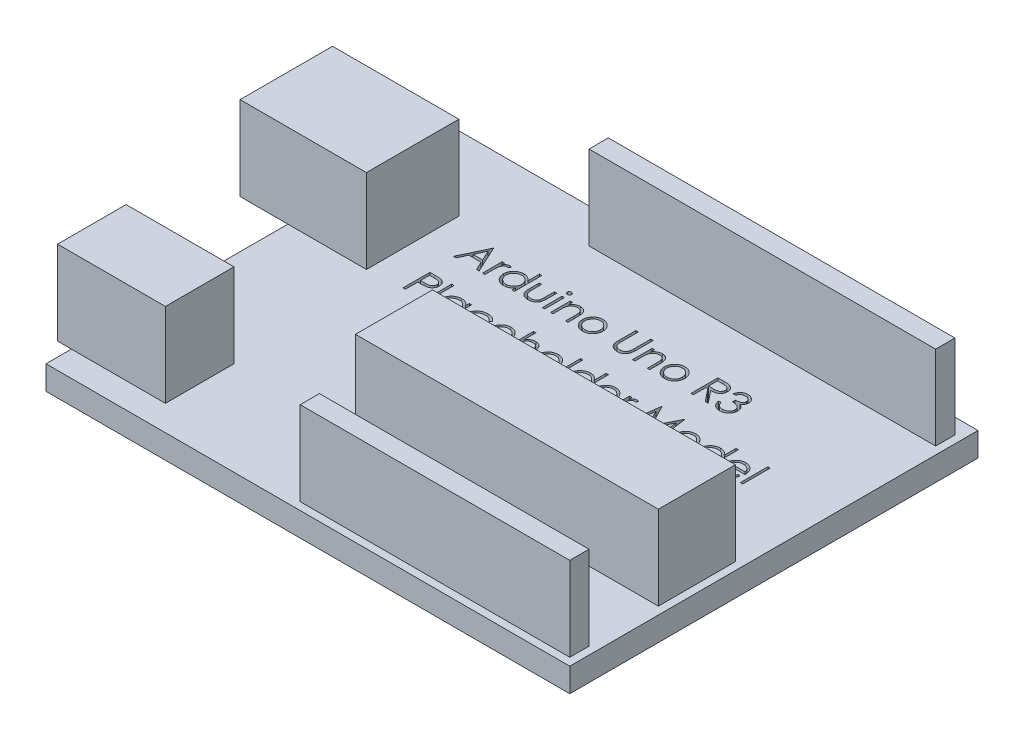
from build123d import *

# Parameters (mm, degrees)
SKETCH2_W           = 68
SKETCH2_H           = 53
BOSS_EXTRUDE1_DEPTH = 3.1
SKETCH3_W           = 6.2
SKETCH3_H           = 12
SKETCH3_W_2         = 4
SKETCH3_W_3         = 12.2
SKETCH3_H_2         = 8.9
SKETCH3_W_4         = 1.8
SKETCH3_W_5         = 39.321237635
SKETCH3_H_3         = 10
SKETCH3_W_6         = 35
SKETCH3_H_4         = 2.5
SKETCH3_W_7         = 45
BOSS_EXTRUDE2_DEPTH = 10.9
SKETCH4_W           = 0.314102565
SKETCH4_H           = 2.557692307
SKETCH4_W_2         = 0.314102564
SKETCH4_H_2         = 3.58974359
CUT_EXTRUDE1_DEPTH  = 5


with BuildPart() as part:
    # Sketch2 → Boss-Extrude1 (new body)
    with BuildSketch(Plane(origin=(0, 0, 0), x_dir=(1, 0, 0), z_dir=(0, 1, 0))):
        Rectangle(SKETCH2_W, SKETCH2_H)
    extrude(amount=BOSS_EXTRUDE1_DEPTH)

    # Sketch3 → Boss-Extrude2 (add)
    with BuildSketch(Plane(origin=(0, 3.1, 0), x_dir=(1, 0, 0), z_dir=(0, 1, 0))):
        with Locations((-37.1, 10.9)):
            Rectangle(SKETCH3_W, SKETCH3_H)
        with Locations((-30.9, 10.9)):
            Rectangle(SKETCH3_W, SKETCH3_H)
        with Locations((-25.8, 10.9)):
            Rectangle(SKETCH3_W_2, SKETCH3_H)
        with Locations((-27.9, -18.75)):
            Rectangle(SKETCH3_W_3, SKETCH3_H_2)
        with Locations((-34.9, -18.75)):
            Rectangle(SKETCH3_W_4, SKETCH3_H_2)
        with Locations((13.339381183, -9)):
            Rectangle(SKETCH3_W_5, SKETCH3_H_3)
        with Locations((15.5, -24.25)):
            Rectangle(SKETCH3_W_6, SKETCH3_H_4)
        with Locations((10.5, 23.25)):
            Rectangle(SKETCH3_W_7, SKETCH3_H_4)
    extrude(amount=BOSS_EXTRUDE2_DEPTH)

    # Sketch4 → Cut-Extrude1 (cut)
    # profile 1 of 29: a face of its own
    with BuildSketch(Plane(origin=(0, 3.1, 0), x_dir=(1, 0, 0), z_dir=(0, 1, 0))):
        Polygon((-17.92691061, 15.533897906), (-16.311525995, 12.033897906), (-16.652972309, 12.033897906), (-17.170400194, 13.155692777), (-18.757038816, 13.155692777), (-19.288489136, 12.033897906), (-19.632038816, 12.033897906), (-17.971782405, 15.533897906), align=None)
        Polygon((-17.952852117, 14.851005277), (-18.585965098, 13.514667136), (-17.335864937, 13.514667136), align=None, mode=Mode.SUBTRACT)
    # profile 2 of 29: a face of its own
    with BuildSketch(Plane(origin=(0, 3.1, 0), x_dir=(1, 0, 0), z_dir=(0, 1, 0))):
        with BuildLine():
            Line((-15.862808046, 14.591590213), (-15.548705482, 14.591590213))
            Line((-15.548705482, 14.591590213), (-15.548705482, 14.215087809))
            add(Edge.make_bspline(
                [(-15.548705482, 14.215087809), (-15.525516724, 14.250143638), (-15.481168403, 14.317187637), (-15.407455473, 14.405856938), (-15.331952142, 14.479271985), (-15.254296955, 14.537775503), (-15.173918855, 14.581588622), (-15.092581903, 14.613681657), (-15.009006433, 14.632658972), (-14.952844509, 14.635192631), (-14.924707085, 14.636462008)],
                knots=[0, 0, 0, 0, 1.2804753, 2.448899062, 3.506932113, 4.484331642, 5.4025378, 6.288909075, 7.142734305, 8, 8, 8, 8], degree=3))
            add(Edge.make_bspline(
                [(-14.924707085, 14.636462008), (-14.902880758, 14.635271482), (-14.857971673, 14.632821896), (-14.789989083, 14.615611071), (-14.719945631, 14.588133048), (-14.674803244, 14.562292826), (-14.651269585, 14.548821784)],
                knots=[0, 0, 0, 0, 0.901110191, 1.854092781, 2.881294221, 4, 4, 4, 4], degree=3))
            Line((-14.651269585, 14.548821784), (-14.823745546, 14.276786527))
            add(Edge.make_bspline(
                [(-14.823745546, 14.276786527), (-14.838854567, 14.283526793), (-14.867534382, 14.296321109), (-14.909488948, 14.311463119), (-14.948170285, 14.320379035), (-14.972813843, 14.321729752), (-14.984302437, 14.322359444)],
                knots=[0, 0, 0, 0, 1.180555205, 2.24091978, 3.179933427, 4, 4, 4, 4], degree=3))
            add(Edge.make_bspline(
                [(-14.984302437, 14.322359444), (-15.009508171, 14.320679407), (-15.060920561, 14.317252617), (-15.13640506, 14.29031381), (-15.209652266, 14.24678857), (-15.267823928, 14.198517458), (-15.312866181, 14.15196966), (-15.345006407, 14.111321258), (-15.374489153, 14.065742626), (-15.402659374, 14.016012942), (-15.428325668, 13.961283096), (-15.452280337, 13.902099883), (-15.4739392, 13.838394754), (-15.486289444, 13.794012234), (-15.492615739, 13.771277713)],
                knots=[0, 0, 0, 0, 1.125678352, 2.296057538, 3.5422874, 4.923748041, 5.663163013, 6.437101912, 7.23742474, 8.08941207, 8.991984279, 9.93940061, 10.944477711, 12, 12, 12, 12], degree=3))
            add(Edge.make_bspline(
                [(-15.492615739, 13.771277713), (-15.497348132, 13.75100054), (-15.507830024, 13.706088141), (-15.518021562, 13.630739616), (-15.52809108, 13.541715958), (-15.535187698, 13.438769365), (-15.54176574, 13.322156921), (-15.545475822, 13.191700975), (-15.548578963, 13.047267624), (-15.54866203, 12.946293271), (-15.548705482, 12.893473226)],
                knots=[0, 0, 0, 0, 0.566838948, 1.255505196, 2.06880316, 3.007127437, 4.065329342, 5.249902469, 6.561414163, 8, 8, 8, 8], degree=3))
            Line((-15.548705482, 12.893473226), (-15.548705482, 12.033897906))
            Line((-15.548705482, 12.033897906), (-15.862808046, 12.033897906))
            Line((-15.862808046, 12.033897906), (-15.862808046, 14.591590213))
        make_face()
    # profile 3 of 29: a face of its own
    with BuildSketch(Plane(origin=(0, 3.1, 0), x_dir=(1, 0, 0), z_dir=(0, 1, 0))):
        with BuildLine():
            Line((-11.734602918, 15.623641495), (-11.734602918, 12.033897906))
            Line((-11.734602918, 12.033897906), (-12.048705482, 12.033897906))
            Line((-12.048705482, 12.033897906), (-12.048705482, 12.476305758))
            add(Edge.make_bspline(
                [(-12.048705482, 12.476305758), (-12.084124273, 12.436266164), (-12.153244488, 12.358128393), (-12.268685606, 12.256046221), (-12.391053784, 12.171667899), (-12.519755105, 12.103517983), (-12.654673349, 12.052325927), (-12.795509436, 12.015939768), (-12.942320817, 11.992545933), (-13.042573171, 11.990209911), (-13.093376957, 11.989026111)],
                knots=[0, 0, 0, 0, 1.074387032, 2.096679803, 3.090159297, 4.057316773, 5.018401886, 5.985159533, 6.978961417, 8, 8, 8, 8], degree=3))
            add(Edge.make_bspline(
                [(-13.093376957, 11.989026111), (-13.13854491, 11.990252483), (-13.227618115, 11.992670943), (-13.358647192, 12.011433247), (-13.484739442, 12.041563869), (-13.606014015, 12.083464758), (-13.72168616, 12.13904558), (-13.832746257, 12.205586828), (-13.938618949, 12.284827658), (-14.037690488, 12.375415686), (-14.128922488, 12.473810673), (-14.208983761, 12.57875622), (-14.275736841, 12.689798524), (-14.331556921, 12.805531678), (-14.374553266, 12.926846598), (-14.4045269, 13.053323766), (-14.423267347, 13.184813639), (-14.425684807, 13.274353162), (-14.42691061, 13.319755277)],
                knots=[0, 0, 0, 0, 1.033919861, 2.038935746, 3.024066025, 3.998881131, 4.97069526, 5.957263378, 6.95902576, 7.993208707, 9.027059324, 10.027763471, 11.009749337, 11.988697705, 12.965288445, 13.950418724, 14.960734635, 16, 16, 16, 16], degree=3))
            add(Edge.make_bspline(
                [(-14.42691061, 13.319755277), (-14.425657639, 13.364218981), (-14.423180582, 13.452121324), (-14.404727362, 13.581400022), (-14.373696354, 13.705918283), (-14.330148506, 13.825275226), (-14.274306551, 13.939615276), (-14.206378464, 14.049019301), (-14.126359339, 14.153788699), (-14.034106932, 14.251459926), (-13.934172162, 14.34168054), (-13.827263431, 14.420089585), (-13.71604015, 14.487806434), (-13.598777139, 14.54145991), (-13.477210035, 14.584869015), (-13.350256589, 14.614901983), (-13.21844501, 14.632599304), (-13.128954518, 14.635162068), (-13.083561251, 14.636462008)],
                knots=[0, 0, 0, 0, 1.020392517, 2.01726096, 2.990465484, 3.961182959, 4.928053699, 5.906110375, 6.912531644, 7.948652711, 8.985773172, 9.998621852, 10.987621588, 11.969261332, 12.953316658, 13.946091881, 14.958173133, 16, 16, 16, 16], degree=3))
            add(Edge.make_bspline(
                [(-13.083561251, 14.636462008), (-13.031344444, 14.634894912), (-12.928848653, 14.631818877), (-12.778950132, 14.60611251), (-12.637162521, 14.562949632), (-12.502669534, 14.503858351), (-12.376272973, 14.427057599), (-12.257046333, 14.334306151), (-12.14706301, 14.222979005), (-12.081991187, 14.139367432), (-12.048705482, 14.096598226)],
                knots=[0, 0, 0, 0, 1.031072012, 2.023879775, 2.993683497, 3.952812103, 4.918022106, 5.908088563, 6.929940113, 8, 8, 8, 8], degree=3))
            Line((-12.048705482, 14.096598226), (-12.048705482, 15.623641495))
            Line((-12.048705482, 15.623641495), (-11.734602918, 15.623641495))
        make_face()
        with BuildLine():
            add(Edge.make_bspline(
                [(-13.079354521, 14.322359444), (-13.125268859, 14.320725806), (-13.215896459, 14.317501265), (-13.348940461, 14.29232777), (-13.476253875, 14.250443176), (-13.597199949, 14.193161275), (-13.709868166, 14.121132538), (-13.810561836, 14.034011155), (-13.900104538, 13.93417414), (-13.975412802, 13.82207203), (-14.036803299, 13.701893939), (-14.079970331, 13.576269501), (-14.108439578, 13.447464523), (-14.111348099, 13.360101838), (-14.112808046, 13.316249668)],
                knots=[0, 0, 0, 0, 1.031046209, 2.035121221, 3.029706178, 4.034933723, 5.034054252, 6.02443088, 7.017295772, 8.038157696, 9.050218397, 10.03989886, 11.016116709, 12, 12, 12, 12], degree=3))
            add(Edge.make_bspline(
                [(-14.112808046, 13.316249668), (-14.110943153, 13.272659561), (-14.107220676, 13.185650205), (-14.080469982, 13.056669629), (-14.035590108, 12.931015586), (-13.974348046, 12.809754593), (-13.897661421, 12.697170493), (-13.808772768, 12.59543037), (-13.706822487, 12.507940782), (-13.59389498, 12.434703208), (-13.47328701, 12.375540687), (-13.346453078, 12.334375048), (-13.21577744, 12.307797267), (-13.126925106, 12.30469279), (-13.082159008, 12.303128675)],
                knots=[0, 0, 0, 0, 0.979072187, 1.954306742, 2.945804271, 3.96968567, 4.997920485, 5.998718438, 6.996577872, 8.005894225, 9.015743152, 10.005417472, 10.995077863, 12, 12, 12, 12], degree=3))
            add(Edge.make_bspline(
                [(-13.082159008, 12.303128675), (-13.036712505, 12.304788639), (-12.946323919, 12.308090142), (-12.812885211, 12.333371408), (-12.683390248, 12.375140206), (-12.55960302, 12.433039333), (-12.444286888, 12.504796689), (-12.340789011, 12.58880378), (-12.253273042, 12.686506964), (-12.179080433, 12.793883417), (-12.120905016, 12.911595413), (-12.078528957, 13.036929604), (-12.053475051, 13.169890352), (-12.050317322, 13.260754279), (-12.048705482, 13.307135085)],
                knots=[0, 0, 0, 0, 1.01762866, 2.023962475, 3.030623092, 4.058876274, 5.077231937, 6.066672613, 7.034107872, 8.005628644, 8.981990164, 9.965428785, 10.961468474, 12, 12, 12, 12], degree=3))
            add(Edge.make_bspline(
                [(-12.048705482, 13.307135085), (-12.049665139, 13.342472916), (-12.051554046, 13.412028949), (-12.065984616, 13.514156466), (-12.088939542, 13.611890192), (-12.121285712, 13.705332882), (-12.163776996, 13.793967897), (-12.215024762, 13.878431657), (-12.275930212, 13.958284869), (-12.345512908, 14.03242794), (-12.421678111, 14.100054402), (-12.502272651, 14.160418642), (-12.588251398, 14.210007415), (-12.678168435, 14.251048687), (-12.77217977, 14.283707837), (-12.871050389, 14.30549553), (-12.973729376, 14.320455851), (-13.043775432, 14.321718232), (-13.079354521, 14.322359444)],
                knots=[0, 0, 0, 0, 1.050140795, 2.067009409, 3.05949893, 4.030605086, 5.00011959, 5.97591094, 6.962425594, 7.979863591, 8.993523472, 9.986985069, 10.967611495, 11.937549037, 12.921786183, 13.919465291, 14.943216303, 16, 16, 16, 16], degree=3))
        make_face(mode=Mode.SUBTRACT)
    # profile 4 of 29: a face of its own
    with BuildSketch(Plane(origin=(0, 3.1, 0), x_dir=(1, 0, 0), z_dir=(0, 1, 0))):
        with BuildLine():
            Line((-11.061525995, 14.591590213), (-10.747423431, 14.591590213))
            Line((-10.747423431, 14.591590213), (-10.747423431, 13.405292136))
            add(Edge.make_bspline(
                [(-10.747423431, 13.405292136), (-10.747281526, 13.370469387), (-10.747010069, 13.303855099), (-10.745169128, 13.207999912), (-10.740839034, 13.1205832), (-10.73542521, 13.041554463), (-10.728463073, 12.970927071), (-10.720179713, 12.908947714), (-10.710921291, 12.85491353), (-10.701858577, 12.822370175), (-10.697643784, 12.807235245)],
                knots=[0, 0, 0, 0, 1.388932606, 2.656963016, 3.823490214, 4.879454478, 5.816252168, 6.653371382, 7.373723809, 8, 8, 8, 8], degree=3))
            add(Edge.make_bspline(
                [(-10.697643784, 12.807235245), (-10.690882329, 12.788212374), (-10.677499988, 12.750562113), (-10.653226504, 12.696173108), (-10.623198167, 12.645797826), (-10.590338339, 12.597493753), (-10.552438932, 12.552691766), (-10.509979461, 12.511467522), (-10.464381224, 12.472263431), (-10.3966262, 12.425878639), (-10.303966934, 12.376163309), (-10.182314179, 12.333267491), (-10.050409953, 12.307631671), (-9.959245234, 12.304657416), (-9.912387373, 12.303128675)],
                knots=[0, 0, 0, 0, 0.725840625, 1.436591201, 2.137033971, 2.831655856, 3.53531722, 4.242432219, 4.957935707, 5.694543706, 7.190802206, 8.724350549, 10.316345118, 12, 12, 12, 12], degree=3))
            add(Edge.make_bspline(
                [(-9.912387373, 12.303128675), (-9.865533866, 12.304689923), (-9.774880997, 12.307710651), (-9.644426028, 12.332494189), (-9.525174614, 12.373899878), (-9.418323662, 12.43170729), (-9.324357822, 12.502449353), (-9.246053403, 12.585458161), (-9.181446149, 12.678107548), (-9.153236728, 12.747231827), (-9.139050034, 12.781994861)],
                knots=[0, 0, 0, 0, 1.157059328, 2.238695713, 3.266970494, 4.264342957, 5.228770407, 6.160125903, 7.074715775, 8, 8, 8, 8], degree=3))
            add(Edge.make_bspline(
                [(-9.139050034, 12.781994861), (-9.134855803, 12.795961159), (-9.125583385, 12.826837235), (-9.115621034, 12.879216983), (-9.106646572, 12.941681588), (-9.098983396, 13.014639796), (-9.093518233, 13.097900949), (-9.090572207, 13.191439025), (-9.087243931, 13.294960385), (-9.087193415, 13.367428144), (-9.087167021, 13.405292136)],
                knots=[0, 0, 0, 0, 0.557542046, 1.232589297, 2.036731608, 2.971723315, 4.038036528, 5.22795436, 6.551621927, 8, 8, 8, 8], degree=3))
            Line((-9.087167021, 13.405292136), (-9.087167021, 14.591590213))
            Line((-9.087167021, 14.591590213), (-8.773064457, 14.591590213))
            Line((-8.773064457, 14.591590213), (-8.773064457, 13.346397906))
            add(Edge.make_bspline(
                [(-8.773064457, 13.346397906), (-8.773506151, 13.304090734), (-8.7743631, 13.222009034), (-8.779870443, 13.102724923), (-8.789320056, 12.991562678), (-8.803662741, 12.888463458), (-8.820528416, 12.793505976), (-8.842284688, 12.70656853), (-8.868262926, 12.627918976), (-8.897568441, 12.556177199), (-8.932190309, 12.491130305), (-8.969017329, 12.429394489), (-9.011542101, 12.372501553), (-9.056312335, 12.317619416), (-9.106113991, 12.267477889), (-9.16001385, 12.220926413), (-9.21725327, 12.177253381), (-9.279102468, 12.138162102), (-9.344658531, 12.102945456), (-9.414002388, 12.071729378), (-9.487983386, 12.047026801), (-9.565647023, 12.025716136), (-9.647373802, 12.009001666), (-9.733084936, 11.9972151), (-9.822751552, 11.989989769), (-9.883861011, 11.989352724), (-9.91519186, 11.989026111)],
                knots=[0, 0, 0, 0, 1.493040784, 2.896703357, 4.213163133, 5.428574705, 6.569057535, 7.615249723, 8.588095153, 9.490268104, 10.346124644, 11.18633936, 12.024365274, 12.850166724, 13.684164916, 14.514361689, 15.362232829, 16.222528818, 17.093394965, 17.986930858, 18.902426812, 19.842810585, 20.827885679, 21.843828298, 22.894529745, 24, 24, 24, 24], degree=3))
            add(Edge.make_bspline(
                [(-9.91519186, 11.989026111), (-9.946288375, 11.989365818), (-10.00739592, 11.990033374), (-10.097067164, 11.997175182), (-10.18301577, 12.008983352), (-10.264936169, 12.02583857), (-10.342910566, 12.04687764), (-10.417254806, 12.071881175), (-10.487098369, 12.102961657), (-10.553280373, 12.137939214), (-10.615282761, 12.17750449), (-10.673391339, 12.220872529), (-10.727528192, 12.267978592), (-10.77770526, 12.31862595), (-10.823218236, 12.373442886), (-10.864634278, 12.431988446), (-10.902590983, 12.493682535), (-10.936943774, 12.559745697), (-10.966455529, 12.632317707), (-10.992510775, 12.712614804), (-11.013821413, 12.801517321), (-11.031163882, 12.898949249), (-11.045115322, 13.004444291), (-11.054801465, 13.118612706), (-11.060217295, 13.241176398), (-11.061080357, 13.325826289), (-11.061525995, 13.369534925)],
                knots=[0, 0, 0, 0, 1.083640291, 2.129454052, 3.13281866, 4.105697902, 5.042300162, 5.946461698, 6.836384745, 7.703652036, 8.553297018, 9.397182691, 10.228592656, 11.052265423, 11.879314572, 12.708807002, 13.549817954, 14.402308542, 15.300838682, 16.27712199, 17.341985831, 18.484375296, 19.725102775, 21.0496083, 22.476576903, 24, 24, 24, 24], degree=3))
            Line((-11.061525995, 13.369534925), (-11.061525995, 14.591590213))
        make_face()
    # profile 5 of 29: a face of its own
    with BuildSketch(Plane(origin=(0, 3.1, 0), x_dir=(1, 0, 0), z_dir=(0, 1, 0))):
        with BuildLine():
            add(Edge.make_bspline(
                [(-7.944338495, 15.66851329), (-7.924847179, 15.667609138), (-7.886679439, 15.665838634), (-7.831486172, 15.650677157), (-7.78122916, 15.624977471), (-7.736651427, 15.59049779), (-7.69839954, 15.549948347), (-7.67161883, 15.502687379), (-7.654406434, 15.45162874), (-7.652327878, 15.416013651), (-7.651269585, 15.397880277)],
                knots=[0, 0, 0, 0, 1.055194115, 2.066272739, 3.074728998, 4.095836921, 5.109056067, 6.073838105, 7.019297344, 8, 8, 8, 8], degree=3))
            add(Edge.make_bspline(
                [(-7.651269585, 15.397880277), (-7.652351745, 15.380217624), (-7.654491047, 15.345300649), (-7.671605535, 15.295127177), (-7.698627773, 15.248522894), (-7.736626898, 15.208052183), (-7.781235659, 15.173591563), (-7.831484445, 15.147886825), (-7.886679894, 15.132726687), (-7.924847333, 15.130955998), (-7.944338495, 15.130051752)],
                knots=[0, 0, 0, 0, 0.96129708, 1.900370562, 2.859976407, 3.87933698, 4.906634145, 5.921202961, 6.938410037, 8, 8, 8, 8], degree=3))
            add(Edge.make_bspline(
                [(-7.944338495, 15.130051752), (-7.96360677, 15.130921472), (-8.00110995, 15.132614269), (-8.055476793, 15.148184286), (-8.105305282, 15.17360036), (-8.149969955, 15.207826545), (-8.187200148, 15.248771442), (-8.214298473, 15.295098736), (-8.231373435, 15.34530789), (-8.233518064, 15.380220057), (-8.234602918, 15.397880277)],
                knots=[0, 0, 0, 0, 1.054934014, 2.053291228, 3.073705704, 4.106921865, 5.123545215, 6.088680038, 7.033164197, 8, 8, 8, 8], degree=3))
            add(Edge.make_bspline(
                [(-8.234602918, 15.397880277), (-8.233541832, 15.416011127), (-8.23145779, 15.45162126), (-8.214285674, 15.502716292), (-8.187425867, 15.549697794), (-8.149945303, 15.590723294), (-8.105311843, 15.624968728), (-8.055475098, 15.65037971), (-8.001110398, 15.665951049), (-7.963606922, 15.667643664), (-7.944338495, 15.66851329)],
                knots=[0, 0, 0, 0, 0.98631895, 1.937192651, 2.907499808, 3.917963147, 4.944918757, 5.95915025, 6.951458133, 8, 8, 8, 8], degree=3))
        make_face()
    # profile 6 of 29: a face of its own
    with BuildSketch(Plane(origin=(0, 3.1, 0), x_dir=(1, 0, 0), z_dir=(0, 1, 0))):
        with Locations((-7.942936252, 13.31274406)):
            Rectangle(SKETCH4_W, SKETCH4_H)
    # profile 7 of 29: a face of its own
    with BuildSketch(Plane(origin=(0, 3.1, 0), x_dir=(1, 0, 0), z_dir=(0, 1, 0))):
        with BuildLine():
            Line((-7.023064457, 14.591590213), (-6.708961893, 14.591590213))
            Line((-6.708961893, 14.591590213), (-6.708961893, 14.130252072))
            add(Edge.make_bspline(
                [(-6.708961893, 14.130252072), (-6.675424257, 14.172094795), (-6.610343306, 14.253292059), (-6.501958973, 14.360012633), (-6.387415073, 14.447957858), (-6.267413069, 14.518061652), (-6.141790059, 14.570908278), (-6.011311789, 14.609074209), (-5.875197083, 14.631959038), (-5.782632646, 14.634949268), (-5.735804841, 14.636462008)],
                knots=[0, 0, 0, 0, 1.12780773, 2.188550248, 3.19190651, 4.159438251, 5.104880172, 6.052711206, 7.014878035, 8, 8, 8, 8], degree=3))
            add(Edge.make_bspline(
                [(-5.735804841, 14.636462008), (-5.688474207, 14.634716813), (-5.595836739, 14.631301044), (-5.460958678, 14.604284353), (-5.334985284, 14.558139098), (-5.218365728, 14.494927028), (-5.113238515, 14.416320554), (-5.020913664, 14.324742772), (-4.944550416, 14.219406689), (-4.893353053, 14.121683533), (-4.859627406, 14.034994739), (-4.838395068, 13.960747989), (-4.820364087, 13.878029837), (-4.804732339, 13.787090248), (-4.794155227, 13.687292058), (-4.785812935, 13.579044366), (-4.779834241, 13.462382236), (-4.779597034, 13.381695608), (-4.779474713, 13.340087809)],
                knots=[0, 0, 0, 0, 1.235846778, 2.418850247, 3.575807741, 4.728682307, 5.871620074, 6.994088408, 8.11269785, 9.256955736, 9.865816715, 10.540099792, 11.271859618, 12.076849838, 12.949306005, 13.892391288, 14.913166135, 16, 16, 16, 16], degree=3))
            Line((-4.779474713, 13.340087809), (-4.779474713, 12.033897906))
            Line((-4.779474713, 12.033897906), (-5.093577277, 12.033897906))
            Line((-5.093577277, 12.033897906), (-5.093577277, 13.237022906))
            add(Edge.make_bspline(
                [(-5.093577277, 13.237022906), (-5.093770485, 13.27184535), (-5.094140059, 13.338454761), (-5.095305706, 13.433823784), (-5.098115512, 13.520310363), (-5.102063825, 13.59770773), (-5.107842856, 13.665941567), (-5.113865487, 13.725150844), (-5.121230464, 13.775260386), (-5.127793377, 13.805425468), (-5.130736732, 13.818953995)],
                knots=[0, 0, 0, 0, 1.430800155, 2.736877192, 3.918605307, 4.986035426, 5.920637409, 6.731861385, 7.431261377, 8, 8, 8, 8], degree=3))
            add(Edge.make_bspline(
                [(-5.130736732, 13.818953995), (-5.141362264, 13.85866518), (-5.161813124, 13.935096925), (-5.212347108, 14.038771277), (-5.276161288, 14.126969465), (-5.354059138, 14.199146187), (-5.445288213, 14.255317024), (-5.549595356, 14.294290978), (-5.665973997, 14.318667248), (-5.747828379, 14.32109438), (-5.790492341, 14.322359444)],
                knots=[0, 0, 0, 0, 1.084156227, 2.086665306, 3.027808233, 3.945421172, 4.874247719, 5.839848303, 6.874090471, 8, 8, 8, 8], degree=3))
            add(Edge.make_bspline(
                [(-5.790492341, 14.322359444), (-5.815760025, 14.321883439), (-5.865764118, 14.320941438), (-5.93991409, 14.31149014), (-6.011838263, 14.296031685), (-6.082258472, 14.275163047), (-6.149766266, 14.246500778), (-6.216530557, 14.213971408), (-6.280037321, 14.173423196), (-6.341640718, 14.128232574), (-6.398953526, 14.078153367), (-6.452281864, 14.025308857), (-6.499819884, 13.969033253), (-6.54288856, 13.910233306), (-6.580066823, 13.848101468), (-6.612519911, 13.783237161), (-6.640055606, 13.715555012), (-6.653738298, 13.668579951), (-6.660584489, 13.64507579)],
                knots=[0, 0, 0, 0, 1.023777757, 2.026029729, 3.023749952, 4.003683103, 4.997618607, 5.993177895, 7.010360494, 8.046726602, 9.087585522, 10.09234134, 11.086953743, 12.070360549, 13.043493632, 14.017870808, 15.008233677, 16, 16, 16, 16], degree=3))
            add(Edge.make_bspline(
                [(-6.660584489, 13.64507579), (-6.664524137, 13.627820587), (-6.673100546, 13.590256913), (-6.682363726, 13.528612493), (-6.690771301, 13.457302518), (-6.69780826, 13.376410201), (-6.702113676, 13.285652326), (-6.706808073, 13.185416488), (-6.708517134, 13.075303), (-6.708809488, 12.998641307), (-6.708961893, 12.958677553)],
                knots=[0, 0, 0, 0, 0.615963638, 1.340920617, 2.168419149, 3.115676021, 4.16674242, 5.331190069, 6.6087489, 8, 8, 8, 8], degree=3))
            Line((-6.708961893, 12.958677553), (-6.708961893, 12.033897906))
            Line((-6.708961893, 12.033897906), (-7.023064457, 12.033897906))
            Line((-7.023064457, 12.033897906), (-7.023064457, 14.591590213))
        make_face()
    # profile 8 of 29: a face of its own
    with BuildSketch(Plane(origin=(0, 3.1, 0), x_dir=(1, 0, 0), z_dir=(0, 1, 0))):
        with BuildLine():
            add(Edge.make_bspline(
                [(-2.826149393, 14.636462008), (-2.77815812, 14.635440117), (-2.684058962, 14.633436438), (-2.546251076, 14.612021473), (-2.41470594, 14.579274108), (-2.288919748, 14.534002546), (-2.170503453, 14.473320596), (-2.057732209, 14.400911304), (-1.9509152, 14.315128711), (-1.88689217, 14.248770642), (-1.854394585, 14.215087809)],
                knots=[0, 0, 0, 0, 1.054011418, 2.066658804, 3.057071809, 4.030435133, 4.997543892, 5.974964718, 6.972108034, 8, 8, 8, 8], degree=3))
            add(Edge.make_bspline(
                [(-1.854394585, 14.215087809), (-1.826412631, 14.182873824), (-1.770990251, 14.119069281), (-1.699924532, 14.015613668), (-1.638702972, 13.908473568), (-1.589640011, 13.796226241), (-1.550954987, 13.67985157), (-1.523489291, 13.558949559), (-1.507152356, 13.433787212), (-1.504949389, 13.348783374), (-1.503833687, 13.305732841)],
                knots=[0, 0, 0, 0, 1.025258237, 2.030674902, 3.01204498, 3.988269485, 4.97094183, 5.956517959, 6.965070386, 8, 8, 8, 8], degree=3))
            add(Edge.make_bspline(
                [(-1.503833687, 13.305732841), (-1.504815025, 13.262432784), (-1.506754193, 13.17686985), (-1.525097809, 13.050850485), (-1.553628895, 12.928655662), (-1.594460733, 12.810796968), (-1.646818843, 12.696914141), (-1.71070953, 12.587504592), (-1.786581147, 12.482352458), (-1.872585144, 12.38235062), (-1.96763702, 12.290184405), (-2.070753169, 12.209856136), (-2.179907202, 12.141034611), (-2.296550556, 12.085598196), (-2.419618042, 12.041888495), (-2.549375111, 12.011188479), (-2.685620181, 11.992626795), (-2.778647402, 11.990243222), (-2.826149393, 11.989026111)],
                knots=[0, 0, 0, 0, 0.998656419, 1.973391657, 2.932242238, 3.890759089, 4.846373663, 5.82037756, 6.809684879, 7.83454468, 8.860553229, 9.859544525, 10.845671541, 11.83227036, 12.833544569, 13.85385346, 14.904124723, 16, 16, 16, 16], degree=3))
            add(Edge.make_bspline(
                [(-2.826149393, 11.989026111), (-2.873884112, 11.990247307), (-2.967374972, 11.992639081), (-3.104100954, 12.011116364), (-3.234090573, 12.041874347), (-3.357319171, 12.085741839), (-3.474464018, 12.141036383), (-3.584250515, 12.209648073), (-3.687450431, 12.290208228), (-3.782522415, 12.382344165), (-3.86852102, 12.482354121), (-3.944394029, 12.58750416), (-4.008284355, 12.696914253), (-4.060642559, 12.810796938), (-4.101474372, 12.92865567), (-4.130005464, 13.050850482), (-4.148349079, 13.176869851), (-4.150288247, 13.262432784), (-4.151269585, 13.305732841)],
                knots=[0, 0, 0, 0, 1.099876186, 2.154163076, 3.173186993, 4.173200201, 5.163417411, 6.152872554, 7.150605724, 8.17532212, 9.198891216, 10.186952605, 11.159729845, 12.11414092, 13.071450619, 14.029093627, 15.002601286, 16, 16, 16, 16], degree=3))
            add(Edge.make_bspline(
                [(-4.151269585, 13.305732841), (-4.150146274, 13.348549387), (-4.147922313, 13.43331879), (-4.131601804, 13.55824585), (-4.104243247, 13.678943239), (-4.065511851, 13.794868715), (-4.01599666, 13.906624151), (-3.955635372, 14.014028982), (-3.88384474, 14.117016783), (-3.828642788, 14.180738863), (-3.800708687, 14.212984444)],
                knots=[0, 0, 0, 0, 1.031353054, 2.041901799, 3.029428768, 4.008703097, 4.981709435, 5.96992636, 6.972712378, 8, 8, 8, 8], degree=3))
            add(Edge.make_bspline(
                [(-3.800708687, 14.212984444), (-3.768260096, 14.246959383), (-3.704444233, 14.313777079), (-3.597095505, 14.399309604), (-3.484601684, 14.473225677), (-3.364876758, 14.532701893), (-3.2391939, 14.579540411), (-3.106974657, 14.612105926), (-2.968699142, 14.633359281), (-2.87413952, 14.635417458), (-2.826149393, 14.636462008)],
                knots=[0, 0, 0, 0, 1.027980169, 2.021703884, 2.998553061, 3.971491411, 4.943284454, 5.930300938, 6.949603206, 8, 8, 8, 8], degree=3))
        make_face()
        with BuildLine():
            add(Edge.make_bspline(
                [(-2.827551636, 14.322359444), (-2.861489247, 14.321394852), (-2.928488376, 14.31949057), (-3.027107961, 14.305006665), (-3.122048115, 14.282059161), (-3.213488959, 14.249455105), (-3.301122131, 14.207356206), (-3.385031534, 14.155647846), (-3.465463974, 14.095014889), (-3.540846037, 14.025552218), (-3.610028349, 13.949673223), (-3.670506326, 13.868824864), (-3.721931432, 13.784318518), (-3.764771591, 13.696066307), (-3.796678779, 13.603173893), (-3.819851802, 13.506693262), (-3.834322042, 13.406427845), (-3.836208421, 13.338266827), (-3.837167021, 13.303629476)],
                knots=[0, 0, 0, 0, 1.021534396, 2.016698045, 2.994645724, 3.958388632, 4.93408049, 5.916473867, 6.921342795, 7.962252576, 8.998418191, 10.008913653, 10.997312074, 11.973003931, 12.956656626, 13.948281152, 14.957379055, 16, 16, 16, 16], degree=3))
            add(Edge.make_bspline(
                [(-3.837167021, 13.303629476), (-3.835560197, 13.258877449), (-3.832370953, 13.170053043), (-3.806435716, 13.039241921), (-3.763049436, 12.913660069), (-3.704462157, 12.794043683), (-3.631055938, 12.683371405), (-3.544568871, 12.58469992), (-3.445929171, 12.499514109), (-3.336312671, 12.428833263), (-3.217958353, 12.372673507), (-3.092702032, 12.332874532), (-2.962061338, 12.307002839), (-2.872780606, 12.304431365), (-2.827551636, 12.303128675)],
                knots=[0, 0, 0, 0, 1.016792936, 2.018143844, 3.017858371, 4.030088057, 5.03801393, 6.028138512, 7.003788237, 7.991172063, 8.984598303, 9.972568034, 10.972917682, 12, 12, 12, 12], degree=3))
            add(Edge.make_bspline(
                [(-2.827551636, 12.303128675), (-2.782325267, 12.304438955), (-2.693049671, 12.307025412), (-2.562590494, 12.332744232), (-2.437676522, 12.372847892), (-2.319445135, 12.428770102), (-2.209878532, 12.499782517), (-2.11052941, 12.584218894), (-2.024780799, 12.683632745), (-1.951447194, 12.794190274), (-1.891900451, 12.913474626), (-1.84871725, 13.039265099), (-1.822719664, 13.170047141), (-1.819538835, 13.258875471), (-1.817936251, 13.303629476)],
                knots=[0, 0, 0, 0, 1.02726834, 2.027799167, 3.010890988, 4.004497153, 4.992059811, 5.971914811, 6.958719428, 7.966827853, 8.981595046, 9.981490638, 10.983022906, 12, 12, 12, 12], degree=3))
            add(Edge.make_bspline(
                [(-1.817936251, 13.303629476), (-1.818894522, 13.338267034), (-1.820780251, 13.406428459), (-1.835255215, 13.506690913), (-1.858410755, 13.60318251), (-1.890382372, 13.696034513), (-1.933036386, 13.784547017), (-1.985453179, 13.868576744), (-2.045684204, 13.94995329), (-2.115701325, 14.025306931), (-2.191004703, 14.095041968), (-2.271469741, 14.155671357), (-2.35525472, 14.207128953), (-2.442633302, 14.249815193), (-2.53408587, 14.281762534), (-2.628892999, 14.305139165), (-2.727091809, 14.319429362), (-2.793850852, 14.321376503), (-2.827551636, 14.322359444)],
                knots=[0, 0, 0, 0, 1.042956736, 2.052379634, 3.044323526, 4.02829302, 5.004299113, 5.996692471, 7.007513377, 8.048758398, 9.090003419, 10.095195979, 11.07790575, 12.047570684, 13.018257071, 13.989683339, 14.985167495, 16, 16, 16, 16], degree=3))
        make_face(mode=Mode.SUBTRACT)
    # profile 9 of 29: a face of its own
    with BuildSketch(Plane(origin=(0, 3.1, 0), x_dir=(1, 0, 0), z_dir=(0, 1, 0))):
        with BuildLine():
            Line((0.560268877, 15.533897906), (0.874371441, 15.533897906))
            Line((0.874371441, 15.533897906), (0.874371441, 13.436842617))
            add(Edge.make_bspline(
                [(0.874371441, 13.436842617), (0.874324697, 13.407161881), (0.874235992, 13.35083757), (0.874828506, 13.27066927), (0.876487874, 13.199396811), (0.877534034, 13.136745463), (0.879861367, 13.083002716), (0.881759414, 13.037877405), (0.884199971, 13.001583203), (0.887133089, 12.980402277), (0.888393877, 12.971297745)],
                knots=[0, 0, 0, 0, 1.528628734, 2.90083645, 4.128790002, 5.200304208, 6.127813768, 6.898992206, 7.526736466, 8, 8, 8, 8], degree=3))
            add(Edge.make_bspline(
                [(0.888393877, 12.971297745), (0.893571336, 12.938450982), (0.903634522, 12.874608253), (0.9292809, 12.783699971), (0.965098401, 12.701768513), (1.007541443, 12.626257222), (1.063474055, 12.559267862), (1.13047759, 12.497556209), (1.211655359, 12.443584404), (1.301915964, 12.394233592), (1.399201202, 12.35456851), (1.498612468, 12.324575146), (1.598655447, 12.306296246), (1.665631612, 12.304179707), (1.698890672, 12.303128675)],
                knots=[0, 0, 0, 0, 1.035780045, 2.013197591, 2.933192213, 3.817615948, 4.702609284, 5.640816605, 6.646850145, 7.73207398, 8.84249596, 9.914020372, 10.964143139, 12, 12, 12, 12], degree=3))
            add(Edge.make_bspline(
                [(1.698890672, 12.303128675), (1.727444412, 12.304202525), (1.784386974, 12.306344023), (1.868993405, 12.319605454), (1.951393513, 12.34350602), (2.031994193, 12.374345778), (2.107545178, 12.41509337), (2.17808862, 12.462164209), (2.241052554, 12.517375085), (2.298510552, 12.57847543), (2.348545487, 12.64741523), (2.391916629, 12.722693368), (2.427442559, 12.805442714), (2.444986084, 12.863597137), (2.453998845, 12.893473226)],
                knots=[0, 0, 0, 0, 0.994687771, 1.983630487, 2.973142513, 3.978332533, 4.983357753, 5.956394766, 6.925816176, 7.893390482, 8.871859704, 9.88551698, 10.913711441, 12, 12, 12, 12], degree=3))
            add(Edge.make_bspline(
                [(2.453998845, 12.893473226), (2.45699897, 12.9058218), (2.463684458, 12.9333394), (2.469931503, 12.979860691), (2.476438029, 13.034750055), (2.480952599, 13.098401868), (2.485353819, 13.17060284), (2.487986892, 13.251729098), (2.489203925, 13.341486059), (2.489566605, 13.40412322), (2.489756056, 13.436842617)],
                knots=[0, 0, 0, 0, 0.558680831, 1.244966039, 2.062412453, 2.990489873, 4.051219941, 5.244515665, 6.560634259, 8, 8, 8, 8], degree=3))
            Line((2.489756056, 13.436842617), (2.489756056, 15.533897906))
            Line((2.489756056, 15.533897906), (2.80385862, 15.533897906))
            Line((2.80385862, 15.533897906), (2.80385862, 13.420015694))
            add(Edge.make_bspline(
                [(2.80385862, 13.420015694), (2.8036045, 13.381917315), (2.803108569, 13.307566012), (2.798807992, 13.198614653), (2.791950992, 13.095261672), (2.782262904, 12.997493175), (2.769425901, 12.905659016), (2.755150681, 12.818954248), (2.736971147, 12.738001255), (2.715737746, 12.662168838), (2.691464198, 12.589983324), (2.66002305, 12.52147471), (2.62459855, 12.45456031), (2.582583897, 12.390252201), (2.535372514, 12.328265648), (2.481920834, 12.268976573), (2.423996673, 12.211437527), (2.360637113, 12.15712446), (2.292886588, 12.107315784), (2.22094663, 12.063518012), (2.145369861, 12.026494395), (2.066352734, 11.996018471), (1.983861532, 11.973103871), (1.897894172, 11.956028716), (1.808254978, 11.946326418), (1.747290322, 11.944884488), (1.716418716, 11.944154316)],
                knots=[0, 0, 0, 0, 1.316592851, 2.569410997, 3.76748051, 4.895814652, 5.963796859, 6.97159953, 7.931736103, 8.829262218, 9.692595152, 10.560224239, 11.431080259, 12.30701507, 13.211635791, 14.121146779, 15.063487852, 16.031507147, 17.00238618, 17.966455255, 18.938106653, 19.907068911, 20.888905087, 21.893141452, 22.933117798, 24, 24, 24, 24], degree=3))
            add(Edge.make_bspline(
                [(1.716418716, 11.944154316), (1.682749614, 11.944939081), (1.616690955, 11.946478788), (1.519352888, 11.955301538), (1.426038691, 11.971919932), (1.335762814, 11.993079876), (1.249754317, 12.022263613), (1.166860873, 12.056361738), (1.088502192, 12.098238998), (1.013407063, 12.144832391), (0.943582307, 12.197257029), (0.879484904, 12.254397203), (0.821009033, 12.315337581), (0.769140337, 12.380737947), (0.723019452, 12.450089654), (0.683289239, 12.523588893), (0.649175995, 12.60120721), (0.631569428, 12.65516041), (0.622668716, 12.682435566)],
                knots=[0, 0, 0, 0, 1.13879206, 2.234305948, 3.301075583, 4.341971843, 5.366689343, 6.369221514, 7.369726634, 8.367512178, 9.355451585, 10.318319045, 11.268648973, 12.207971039, 13.137398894, 14.081662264, 15.030215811, 16, 16, 16, 16], degree=3))
            add(Edge.make_bspline(
                [(0.622668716, 12.682435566), (0.617491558, 12.70106814), (0.606262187, 12.741482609), (0.594236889, 12.808369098), (0.584127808, 12.885384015), (0.574622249, 12.972532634), (0.569013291, 13.0698825), (0.564095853, 13.177391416), (0.560234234, 13.295189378), (0.560257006, 13.377243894), (0.560268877, 13.420015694)],
                knots=[0, 0, 0, 0, 0.625038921, 1.35572334, 2.194682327, 3.136881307, 4.189498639, 5.346923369, 6.617055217, 8, 8, 8, 8], degree=3))
            Line((0.560268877, 13.420015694), (0.560268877, 15.533897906))
        make_face()
    # profile 10 of 29: a face of its own
    with BuildSketch(Plane(origin=(0, 3.1, 0), x_dir=(1, 0, 0), z_dir=(0, 1, 0))):
        with BuildLine():
            Line((3.611550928, 14.591590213), (3.925653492, 14.591590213))
            Line((3.925653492, 14.591590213), (3.925653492, 14.130252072))
            add(Edge.make_bspline(
                [(3.925653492, 14.130252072), (3.959191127, 14.172094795), (4.024272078, 14.253292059), (4.132656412, 14.360012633), (4.247200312, 14.447957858), (4.367202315, 14.518061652), (4.492825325, 14.570908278), (4.623303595, 14.609074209), (4.759418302, 14.631959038), (4.851982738, 14.634949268), (4.898810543, 14.636462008)],
                knots=[0, 0, 0, 0, 1.12780773, 2.188550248, 3.19190651, 4.159438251, 5.104880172, 6.052711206, 7.014878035, 8, 8, 8, 8], degree=3))
            add(Edge.make_bspline(
                [(4.898810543, 14.636462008), (4.946141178, 14.634716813), (5.038778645, 14.631301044), (5.173656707, 14.604284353), (5.2996301, 14.558139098), (5.416249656, 14.494927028), (5.521376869, 14.416320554), (5.613701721, 14.324742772), (5.690064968, 14.219406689), (5.741262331, 14.121683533), (5.774987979, 14.034994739), (5.796220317, 13.960747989), (5.814251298, 13.878029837), (5.829883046, 13.787090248), (5.840460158, 13.687292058), (5.848802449, 13.579044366), (5.854781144, 13.462382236), (5.855018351, 13.381695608), (5.855140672, 13.340087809)],
                knots=[0, 0, 0, 0, 1.235846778, 2.418850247, 3.575807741, 4.728682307, 5.871620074, 6.994088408, 8.11269785, 9.256955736, 9.865816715, 10.540099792, 11.271859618, 12.076849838, 12.949306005, 13.892391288, 14.913166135, 16, 16, 16, 16], degree=3))
            Line((5.855140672, 13.340087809), (5.855140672, 12.033897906))
            Line((5.855140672, 12.033897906), (5.541038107, 12.033897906))
            Line((5.541038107, 12.033897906), (5.541038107, 13.237022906))
            add(Edge.make_bspline(
                [(5.541038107, 13.237022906), (5.540844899, 13.27184535), (5.540475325, 13.338454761), (5.539309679, 13.433823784), (5.536499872, 13.520310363), (5.532551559, 13.59770773), (5.526772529, 13.665941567), (5.520749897, 13.725150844), (5.513384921, 13.775260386), (5.506822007, 13.805425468), (5.503878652, 13.818953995)],
                knots=[0, 0, 0, 0, 1.430800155, 2.736877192, 3.918605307, 4.986035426, 5.920637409, 6.731861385, 7.431261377, 8, 8, 8, 8], degree=3))
            add(Edge.make_bspline(
                [(5.503878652, 13.818953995), (5.493253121, 13.85866518), (5.47280226, 13.935096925), (5.422268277, 14.038771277), (5.358454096, 14.126969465), (5.280556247, 14.199146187), (5.189327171, 14.255317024), (5.085020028, 14.294290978), (4.968641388, 14.318667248), (4.886787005, 14.32109438), (4.844123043, 14.322359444)],
                knots=[0, 0, 0, 0, 1.084156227, 2.086665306, 3.027808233, 3.945421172, 4.874247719, 5.839848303, 6.874090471, 8, 8, 8, 8], degree=3))
            add(Edge.make_bspline(
                [(4.844123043, 14.322359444), (4.81885536, 14.321883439), (4.768851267, 14.320941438), (4.694701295, 14.31149014), (4.622777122, 14.296031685), (4.552356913, 14.275163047), (4.484849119, 14.246500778), (4.418084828, 14.213971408), (4.354578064, 14.173423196), (4.292974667, 14.128232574), (4.235661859, 14.078153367), (4.18233352, 14.025308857), (4.1347955, 13.969033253), (4.091726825, 13.910233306), (4.054548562, 13.848101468), (4.022095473, 13.783237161), (3.994559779, 13.715555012), (3.980877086, 13.668579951), (3.974030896, 13.64507579)],
                knots=[0, 0, 0, 0, 1.023777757, 2.026029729, 3.023749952, 4.003683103, 4.997618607, 5.993177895, 7.010360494, 8.046726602, 9.087585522, 10.09234134, 11.086953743, 12.070360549, 13.043493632, 14.017870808, 15.008233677, 16, 16, 16, 16], degree=3))
            add(Edge.make_bspline(
                [(3.974030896, 13.64507579), (3.970091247, 13.627820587), (3.961514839, 13.590256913), (3.952251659, 13.528612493), (3.943844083, 13.457302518), (3.936807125, 13.376410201), (3.932501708, 13.285652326), (3.927807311, 13.185416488), (3.92609825, 13.075303), (3.925805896, 12.998641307), (3.925653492, 12.958677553)],
                knots=[0, 0, 0, 0, 0.615963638, 1.340920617, 2.168419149, 3.115676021, 4.16674242, 5.331190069, 6.6087489, 8, 8, 8, 8], degree=3))
            Line((3.925653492, 12.958677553), (3.925653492, 12.033897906))
            Line((3.925653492, 12.033897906), (3.611550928, 12.033897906))
            Line((3.611550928, 12.033897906), (3.611550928, 14.591590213))
        make_face()
    # profile 11 of 29: a face of its own
    with BuildSketch(Plane(origin=(0, 3.1, 0), x_dir=(1, 0, 0), z_dir=(0, 1, 0))):
        with BuildLine():
            add(Edge.make_bspline(
                [(7.808465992, 14.636462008), (7.856457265, 14.635440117), (7.950556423, 14.633436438), (8.088364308, 14.612021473), (8.219909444, 14.579274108), (8.345695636, 14.534002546), (8.464111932, 14.473320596), (8.576883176, 14.400911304), (8.683700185, 14.315128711), (8.747723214, 14.248770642), (8.7802208, 14.215087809)],
                knots=[0, 0, 0, 0, 1.054011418, 2.066658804, 3.057071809, 4.030435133, 4.997543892, 5.974964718, 6.972108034, 8, 8, 8, 8], degree=3))
            add(Edge.make_bspline(
                [(8.7802208, 14.215087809), (8.808202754, 14.182873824), (8.863625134, 14.119069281), (8.934690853, 14.015613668), (8.995912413, 13.908473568), (9.044975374, 13.796226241), (9.083660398, 13.67985157), (9.111126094, 13.558949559), (9.127463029, 13.433787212), (9.129665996, 13.348783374), (9.130781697, 13.305732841)],
                knots=[0, 0, 0, 0, 1.025258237, 2.030674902, 3.01204498, 3.988269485, 4.97094183, 5.956517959, 6.965070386, 8, 8, 8, 8], degree=3))
            add(Edge.make_bspline(
                [(9.130781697, 13.305732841), (9.12980036, 13.262432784), (9.127861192, 13.17686985), (9.109517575, 13.050850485), (9.080986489, 12.928655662), (9.040154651, 12.810796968), (8.987796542, 12.696914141), (8.923905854, 12.587504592), (8.848034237, 12.482352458), (8.76203024, 12.38235062), (8.666978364, 12.290184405), (8.563862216, 12.209856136), (8.454708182, 12.141034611), (8.338064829, 12.085598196), (8.214997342, 12.041888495), (8.085240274, 12.011188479), (7.948995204, 11.992626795), (7.855967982, 11.990243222), (7.808465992, 11.989026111)],
                knots=[0, 0, 0, 0, 0.998656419, 1.973391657, 2.932242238, 3.890759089, 4.846373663, 5.82037756, 6.809684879, 7.83454468, 8.860553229, 9.859544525, 10.845671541, 11.83227036, 12.833544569, 13.85385346, 14.904124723, 16, 16, 16, 16], degree=3))
            add(Edge.make_bspline(
                [(7.808465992, 11.989026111), (7.760731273, 11.990247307), (7.667240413, 11.992639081), (7.530514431, 12.011116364), (7.400524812, 12.041874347), (7.277296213, 12.085741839), (7.160151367, 12.141036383), (7.05036487, 12.209648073), (6.947164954, 12.290208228), (6.85209297, 12.382344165), (6.766094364, 12.482354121), (6.690221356, 12.58750416), (6.62633103, 12.696914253), (6.573972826, 12.810796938), (6.533141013, 12.92865567), (6.50460992, 13.050850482), (6.486266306, 13.176869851), (6.484327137, 13.262432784), (6.4833458, 13.305732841)],
                knots=[0, 0, 0, 0, 1.099876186, 2.154163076, 3.173186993, 4.173200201, 5.163417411, 6.152872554, 7.150605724, 8.17532212, 9.198891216, 10.186952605, 11.159729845, 12.11414092, 13.071450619, 14.029093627, 15.002601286, 16, 16, 16, 16], degree=3))
            add(Edge.make_bspline(
                [(6.4833458, 13.305732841), (6.48446911, 13.348549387), (6.486693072, 13.43331879), (6.503013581, 13.55824585), (6.530372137, 13.678943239), (6.569103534, 13.794868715), (6.618618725, 13.906624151), (6.678980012, 14.014028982), (6.750770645, 14.117016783), (6.805972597, 14.180738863), (6.833906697, 14.212984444)],
                knots=[0, 0, 0, 0, 1.031353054, 2.041901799, 3.029428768, 4.008703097, 4.981709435, 5.96992636, 6.972712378, 8, 8, 8, 8], degree=3))
            add(Edge.make_bspline(
                [(6.833906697, 14.212984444), (6.866355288, 14.246959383), (6.930171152, 14.313777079), (7.03751988, 14.399309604), (7.150013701, 14.473225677), (7.269738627, 14.532701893), (7.395421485, 14.579540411), (7.527640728, 14.612105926), (7.665916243, 14.633359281), (7.760475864, 14.635417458), (7.808465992, 14.636462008)],
                knots=[0, 0, 0, 0, 1.027980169, 2.021703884, 2.998553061, 3.971491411, 4.943284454, 5.930300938, 6.949603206, 8, 8, 8, 8], degree=3))
        make_face()
        with BuildLine():
            add(Edge.make_bspline(
                [(7.807063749, 14.322359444), (7.773126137, 14.321394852), (7.706127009, 14.31949057), (7.607507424, 14.305006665), (7.51256727, 14.282059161), (7.421126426, 14.249455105), (7.333493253, 14.207356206), (7.249583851, 14.155647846), (7.169151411, 14.095014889), (7.093769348, 14.025552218), (7.024587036, 13.949673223), (6.964109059, 13.868824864), (6.912683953, 13.784318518), (6.869843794, 13.696066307), (6.837936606, 13.603173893), (6.814763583, 13.506693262), (6.800293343, 13.406427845), (6.798406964, 13.338266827), (6.797448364, 13.303629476)],
                knots=[0, 0, 0, 0, 1.021534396, 2.016698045, 2.994645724, 3.958388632, 4.93408049, 5.916473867, 6.921342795, 7.962252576, 8.998418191, 10.008913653, 10.997312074, 11.973003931, 12.956656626, 13.948281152, 14.957379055, 16, 16, 16, 16], degree=3))
            add(Edge.make_bspline(
                [(6.797448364, 13.303629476), (6.799055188, 13.258877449), (6.802244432, 13.170053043), (6.828179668, 13.039241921), (6.871565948, 12.913660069), (6.930153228, 12.794043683), (7.003559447, 12.683371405), (7.090046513, 12.58469992), (7.188686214, 12.499514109), (7.298302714, 12.428833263), (7.416657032, 12.372673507), (7.541913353, 12.332874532), (7.672554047, 12.307002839), (7.761834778, 12.304431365), (7.807063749, 12.303128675)],
                knots=[0, 0, 0, 0, 1.016792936, 2.018143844, 3.017858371, 4.030088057, 5.03801393, 6.028138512, 7.003788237, 7.991172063, 8.984598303, 9.972568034, 10.972917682, 12, 12, 12, 12], degree=3))
            add(Edge.make_bspline(
                [(7.807063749, 12.303128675), (7.852290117, 12.304438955), (7.941565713, 12.307025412), (8.07202489, 12.332744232), (8.196938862, 12.372847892), (8.31517025, 12.428770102), (8.424736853, 12.499782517), (8.524085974, 12.584218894), (8.609834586, 12.683632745), (8.68316819, 12.794190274), (8.742714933, 12.913474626), (8.785898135, 13.039265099), (8.811895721, 13.170047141), (8.81507655, 13.258875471), (8.816679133, 13.303629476)],
                knots=[0, 0, 0, 0, 1.02726834, 2.027799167, 3.010890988, 4.004497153, 4.992059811, 5.971914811, 6.958719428, 7.966827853, 8.981595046, 9.981490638, 10.983022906, 12, 12, 12, 12], degree=3))
            add(Edge.make_bspline(
                [(8.816679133, 13.303629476), (8.815720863, 13.338267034), (8.813835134, 13.406428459), (8.79936017, 13.506690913), (8.77620463, 13.60318251), (8.744233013, 13.696034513), (8.701578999, 13.784547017), (8.649162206, 13.868576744), (8.58893118, 13.94995329), (8.518914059, 14.025306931), (8.443610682, 14.095041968), (8.363145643, 14.155671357), (8.279360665, 14.207128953), (8.191982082, 14.249815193), (8.100529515, 14.281762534), (8.005722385, 14.305139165), (7.907523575, 14.319429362), (7.840764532, 14.321376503), (7.807063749, 14.322359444)],
                knots=[0, 0, 0, 0, 1.042956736, 2.052379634, 3.044323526, 4.02829302, 5.004299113, 5.996692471, 7.007513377, 8.048758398, 9.090003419, 10.095195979, 11.07790575, 12.047570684, 13.018257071, 13.989683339, 14.985167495, 16, 16, 16, 16], degree=3))
        make_face(mode=Mode.SUBTRACT)
    # profile 12 of 29: a face of its own
    with BuildSketch(Plane(origin=(0, 3.1, 0), x_dir=(1, 0, 0), z_dir=(0, 1, 0))):
        with BuildLine():
            Line((11.194884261, 15.533897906), (11.895304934, 15.533897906))
            add(Edge.make_bspline(
                [(11.895304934, 15.533897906), (11.942046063, 15.53374232), (12.031794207, 15.533443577), (12.160367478, 15.531777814), (12.277194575, 15.527003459), (12.382214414, 15.522894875), (12.475425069, 15.515402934), (12.55711236, 15.508242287), (12.626900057, 15.498868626), (12.669145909, 15.490163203), (12.688273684, 15.486221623)],
                knots=[0, 0, 0, 0, 1.410062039, 2.707475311, 3.878576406, 4.937260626, 5.877586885, 6.699081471, 7.410979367, 8, 8, 8, 8], degree=3))
            add(Edge.make_bspline(
                [(12.688273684, 15.486221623), (12.713880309, 15.479894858), (12.764547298, 15.467376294), (12.837497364, 15.440916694), (12.907011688, 15.410297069), (12.972801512, 15.374333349), (13.034537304, 15.332758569), (13.092855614, 15.286290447), (13.148021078, 15.235183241), (13.197802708, 15.178148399), (13.24474176, 15.11831189), (13.284330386, 15.053608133), (13.318456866, 14.985946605), (13.345627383, 14.914639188), (13.367505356, 14.840377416), (13.382931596, 14.762488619), (13.392182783, 14.681327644), (13.393124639, 14.625969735), (13.39360221, 14.597900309)],
                knots=[0, 0, 0, 0, 1.027469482, 2.033020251, 3.019912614, 3.986113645, 4.951240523, 5.91722682, 6.890402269, 7.87763091, 8.8651537, 9.85103654, 10.82876324, 11.815024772, 12.821070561, 13.842952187, 14.906261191, 16, 16, 16, 16], degree=3))
            add(Edge.make_bspline(
                [(13.39360221, 14.597900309), (13.392133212, 14.551265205), (13.389266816, 14.460268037), (13.362541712, 14.328207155), (13.318765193, 14.205017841), (13.258441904, 14.090855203), (13.181622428, 13.987944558), (13.089297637, 13.897554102), (12.981416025, 13.82191419), (12.880986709, 13.769461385), (12.79227251, 13.735868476), (12.719239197, 13.712232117), (12.63957222, 13.693970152), (12.554034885, 13.67761002), (12.462271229, 13.665258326), (12.36450119, 13.656211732), (12.260655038, 13.650557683), (12.189315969, 13.649715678), (12.152616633, 13.649282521)],
                knots=[0, 0, 0, 0, 1.260483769, 2.459530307, 3.627416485, 4.787058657, 5.939039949, 7.08810263, 8.267026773, 9.491475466, 10.141966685, 10.831826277, 11.566392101, 12.351337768, 13.187381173, 14.07005841, 15.007169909, 16, 16, 16, 16], degree=3))
            Line((12.152616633, 13.649282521), (13.438474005, 12.033897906))
            Line((13.438474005, 12.033897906), (13.050052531, 12.033897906))
            Line((13.050052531, 12.033897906), (11.764195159, 13.649282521))
            Line((11.764195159, 13.649282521), (11.508986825, 13.649282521))
            Line((11.508986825, 13.649282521), (11.508986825, 12.033897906))
            Line((11.508986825, 12.033897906), (11.194884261, 12.033897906))
            Line((11.194884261, 12.033897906), (11.194884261, 15.533897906))
        make_face()
        with BuildLine():
            Line((11.508986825, 15.174923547), (11.508986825, 14.00825688))
            Line((11.508986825, 14.00825688), (12.149812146, 14.003349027))
            add(Edge.make_bspline(
                [(12.149812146, 14.003349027), (12.179732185, 14.003335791), (12.237725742, 14.003310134), (12.321626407, 14.007303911), (12.399746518, 14.011847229), (12.471787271, 14.018796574), (12.537780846, 14.027752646), (12.597694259, 14.03895563), (12.651625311, 14.052007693), (12.71452385, 14.072209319), (12.784760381, 14.104215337), (12.861091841, 14.150780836), (12.926094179, 14.209349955), (12.981012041, 14.276323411), (13.025141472, 14.34995966), (13.056253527, 14.429376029), (13.075995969, 14.512567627), (13.078324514, 14.569745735), (13.079499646, 14.598601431)],
                knots=[0, 0, 0, 0, 1.146690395, 2.22261258, 3.21895312, 4.145990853, 4.996080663, 5.770904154, 6.481378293, 7.121626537, 8.300444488, 9.431385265, 10.535395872, 11.636531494, 12.74115979, 13.810798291, 14.895190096, 16, 16, 16, 16], degree=3))
            add(Edge.make_bspline(
                [(13.079499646, 14.598601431), (13.078297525, 14.626748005), (13.07591536, 14.682524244), (13.056466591, 14.764180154), (13.02357721, 14.841247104), (12.979254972, 14.913411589), (12.925255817, 14.978917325), (12.861938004, 15.034964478), (12.791032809, 15.081213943), (12.724761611, 15.110768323), (12.665527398, 15.128888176), (12.614097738, 15.14163934), (12.55598626, 15.151883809), (12.490910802, 15.16009187), (12.419149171, 15.167146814), (12.34033852, 15.171898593), (12.25500174, 15.174712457), (12.195854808, 15.174851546), (12.165236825, 15.174923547)],
                knots=[0, 0, 0, 0, 1.101028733, 2.181837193, 3.264309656, 4.369019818, 5.486613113, 6.575447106, 7.666700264, 8.788928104, 9.402425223, 10.0903467, 10.862060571, 11.710948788, 12.657782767, 13.684531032, 14.801375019, 16, 16, 16, 16], degree=3))
            Line((12.165236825, 15.174923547), (11.508986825, 15.174923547))
        make_face(mode=Mode.SUBTRACT)
    # profile 13 of 29: a face of its own
    with BuildSketch(Plane(origin=(0, 3.1, 0), x_dir=(1, 0, 0), z_dir=(0, 1, 0))):
        with BuildLine():
            Line((14.291038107, 14.726205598), (13.976935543, 14.726205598))
            add(Edge.make_bspline(
                [(13.976935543, 14.726205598), (13.985445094, 14.761438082), (14.00208057, 14.830314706), (14.036778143, 14.928721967), (14.074577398, 15.021845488), (14.119966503, 15.107941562), (14.169475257, 15.188740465), (14.226197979, 15.262409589), (14.287517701, 15.330822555), (14.35534265, 15.391535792), (14.426471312, 15.446513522), (14.501905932, 15.493388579), (14.580128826, 15.533712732), (14.661681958, 15.566932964), (14.74680813, 15.591958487), (14.834737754, 15.610115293), (14.925701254, 15.621906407), (14.987448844, 15.62305717), (15.018802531, 15.623641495)],
                knots=[0, 0, 0, 0, 1.162005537, 2.271625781, 3.343758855, 4.383309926, 5.390229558, 6.379919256, 7.361854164, 8.333198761, 9.295911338, 10.242430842, 11.177959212, 12.116337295, 13.062827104, 14.020064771, 14.994644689, 16, 16, 16, 16], degree=3))
            add(Edge.make_bspline(
                [(15.018802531, 15.623641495), (15.064485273, 15.622262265), (15.154854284, 15.61953389), (15.287617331, 15.594619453), (15.41564415, 15.555194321), (15.537533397, 15.500720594), (15.65075183, 15.43353328), (15.751488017, 15.353568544), (15.838376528, 15.262369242), (15.911270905, 15.161636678), (15.968345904, 15.053981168), (16.010432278, 14.943181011), (16.036053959, 14.82949904), (16.039374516, 14.752741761), (16.041038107, 14.714286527)],
                knots=[0, 0, 0, 0, 1.083050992, 2.142477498, 3.193116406, 4.255571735, 5.30263384, 6.308962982, 7.297363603, 8.282367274, 9.249857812, 10.179914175, 11.08814088, 12, 12, 12, 12], degree=3))
            add(Edge.make_bspline(
                [(16.041038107, 14.714286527), (16.039874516, 14.677279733), (16.037597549, 14.604863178), (16.018263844, 14.499141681), (15.985727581, 14.399500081), (15.940657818, 14.305518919), (15.882316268, 14.217794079), (15.811643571, 14.136128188), (15.728140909, 14.06015903), (15.664861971, 14.016639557), (15.632284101, 13.994234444)],
                knots=[0, 0, 0, 0, 1.024540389, 2.004866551, 2.965041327, 3.920577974, 4.882998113, 5.874504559, 6.905732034, 8, 8, 8, 8], degree=3))
            add(Edge.make_bspline(
                [(15.632284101, 13.994234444), (15.669515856, 13.976256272), (15.74328273, 13.940636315), (15.843833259, 13.870780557), (15.935111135, 13.79012421), (15.986014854, 13.727181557), (16.011590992, 13.695556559)],
                knots=[0, 0, 0, 0, 1.015518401, 2.012035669, 3.001164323, 4, 4, 4, 4], degree=3))
            add(Edge.make_bspline(
                [(16.011590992, 13.695556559), (16.028432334, 13.672498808), (16.061839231, 13.626760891), (16.103074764, 13.553224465), (16.140483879, 13.478872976), (16.169634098, 13.40171357), (16.192207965, 13.322640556), (16.208343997, 13.24151816), (16.218368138, 13.158280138), (16.21980369, 13.101967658), (16.220525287, 13.073661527)],
                knots=[0, 0, 0, 0, 1.025084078, 2.033381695, 3.024893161, 4.013698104, 4.991890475, 5.976764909, 6.982997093, 8, 8, 8, 8], degree=3))
            add(Edge.make_bspline(
                [(16.220525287, 13.073661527), (16.218730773, 13.024651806), (16.215150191, 12.926863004), (16.183146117, 12.782388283), (16.133532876, 12.64116278), (16.06307594, 12.506087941), (15.977208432, 12.37970756), (15.875051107, 12.266631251), (15.757764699, 12.169432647), (15.62695905, 12.088222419), (15.485241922, 12.023304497), (15.33366633, 11.978247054), (15.174416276, 11.948901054), (15.065208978, 11.945754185), (15.009687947, 11.944154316)],
                knots=[0, 0, 0, 0, 0.955779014, 1.907060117, 2.875433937, 3.871313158, 4.872415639, 5.851225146, 6.836215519, 7.83643374, 8.849228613, 9.86973379, 10.916971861, 12, 12, 12, 12], degree=3))
            add(Edge.make_bspline(
                [(15.009687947, 11.944154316), (14.972268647, 11.945022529), (14.898639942, 11.946730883), (14.790396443, 11.958409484), (14.687074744, 11.97973949), (14.588535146, 12.008442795), (14.49469011, 12.044834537), (14.405826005, 12.090153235), (14.321396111, 12.143464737), (14.24219716, 12.205398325), (14.168238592, 12.274679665), (14.101485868, 12.352538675), (14.040826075, 12.437536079), (13.987883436, 12.530659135), (13.940246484, 12.630704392), (13.901065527, 12.73895289), (13.866579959, 12.854436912), (13.850546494, 12.934914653), (13.842320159, 12.976205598)],
                knots=[0, 0, 0, 0, 1.048658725, 2.063410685, 3.046034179, 4.001477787, 4.936774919, 5.862367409, 6.792675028, 7.730719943, 8.675894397, 9.627829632, 10.600096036, 11.597688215, 12.626045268, 13.701542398, 14.82072376, 16, 16, 16, 16], degree=3))
            Line((13.842320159, 12.976205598), (14.156422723, 12.976205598))
            add(Edge.make_bspline(
                [(14.156422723, 12.976205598), (14.164606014, 12.949256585), (14.180523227, 12.896838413), (14.207617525, 12.821398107), (14.238485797, 12.752240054), (14.271600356, 12.688856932), (14.306378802, 12.63062453), (14.345293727, 12.579082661), (14.385462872, 12.531967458), (14.415742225, 12.505422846), (14.430561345, 12.492431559)],
                knots=[0, 0, 0, 0, 1.198163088, 2.33053128, 3.407730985, 4.417276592, 5.372219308, 6.28897303, 7.162600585, 8, 8, 8, 8], degree=3))
            add(Edge.make_bspline(
                [(14.430561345, 12.492431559), (14.450157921, 12.477323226), (14.489290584, 12.447153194), (14.553058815, 12.408651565), (14.620123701, 12.37529054), (14.691938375, 12.349806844), (14.766953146, 12.328229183), (14.846380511, 12.314108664), (14.929519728, 12.304420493), (14.986287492, 12.303565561), (15.015296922, 12.303128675)],
                knots=[0, 0, 0, 0, 0.946170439, 1.889420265, 2.845303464, 3.807233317, 4.801018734, 5.828864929, 6.890507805, 8, 8, 8, 8], degree=3))
            add(Edge.make_bspline(
                [(15.015296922, 12.303128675), (15.048050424, 12.30374458), (15.112097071, 12.30494893), (15.20555193, 12.316024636), (15.294459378, 12.33215505), (15.377832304, 12.357068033), (15.456762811, 12.387848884), (15.530144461, 12.42649729), (15.598940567, 12.471842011), (15.662269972, 12.52338117), (15.71921548, 12.579802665), (15.769354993, 12.638815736), (15.811979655, 12.700171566), (15.846363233, 12.764209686), (15.873513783, 12.830664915), (15.891996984, 12.899723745), (15.904848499, 12.970821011), (15.905895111, 13.01914998), (15.906422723, 13.04351329)],
                knots=[0, 0, 0, 0, 1.217147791, 2.380027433, 3.494444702, 4.572153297, 5.609568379, 6.639424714, 7.649109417, 8.668170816, 9.669597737, 10.625200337, 11.543417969, 12.441394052, 13.322311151, 14.205496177, 15.095365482, 16, 16, 16, 16], degree=3))
            add(Edge.make_bspline(
                [(15.906422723, 13.04351329), (15.904892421, 13.076124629), (15.901839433, 13.141185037), (15.878530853, 13.236902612), (15.840191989, 13.329126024), (15.786519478, 13.416281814), (15.721183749, 13.497057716), (15.644818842, 13.569129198), (15.556790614, 13.628599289), (15.475770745, 13.669687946), (15.404005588, 13.697725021), (15.342590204, 13.716399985), (15.273833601, 13.732213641), (15.198567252, 13.746925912), (15.116224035, 13.759447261), (15.026893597, 13.769889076), (14.930557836, 13.778244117), (14.86386667, 13.781975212), (14.829499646, 13.783897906)],
                knots=[0, 0, 0, 0, 1.07054697, 2.135767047, 3.216561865, 4.33974944, 5.486079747, 6.621378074, 7.775625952, 8.963672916, 9.598146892, 10.304877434, 11.070270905, 11.915000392, 12.823868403, 13.805723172, 14.86925407, 16, 16, 16, 16], degree=3))
            Line((14.829499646, 13.783897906), (14.829499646, 14.142872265))
            add(Edge.make_bspline(
                [(14.829499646, 14.142872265), (14.872800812, 14.143607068), (14.957617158, 14.145046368), (15.081511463, 14.162454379), (15.199984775, 14.186535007), (15.310411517, 14.223420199), (15.41106023, 14.266260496), (15.498379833, 14.316112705), (15.57114698, 14.371527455), (15.629008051, 14.433360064), (15.67253728, 14.499675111), (15.704364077, 14.568791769), (15.723164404, 14.64131583), (15.725674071, 14.690810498), (15.726935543, 14.715688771)],
                knots=[0, 0, 0, 0, 1.321986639, 2.589447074, 3.816329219, 5.01088745, 6.139805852, 7.153945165, 8.075214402, 8.924034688, 9.728124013, 10.488707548, 11.240355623, 12, 12, 12, 12], degree=3))
            add(Edge.make_bspline(
                [(15.726935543, 14.715688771), (15.726521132, 14.733966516), (15.725696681, 14.770329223), (15.715299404, 14.823454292), (15.699675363, 14.874955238), (15.678195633, 14.924613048), (15.649445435, 14.972083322), (15.615039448, 15.017770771), (15.574071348, 15.06141455), (15.527125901, 15.102094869), (15.476714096, 15.140864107), (15.421464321, 15.173777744), (15.363042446, 15.201922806), (15.301383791, 15.225132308), (15.236288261, 15.242591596), (15.168061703, 15.255127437), (15.09657402, 15.262965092), (15.047802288, 15.264093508), (15.023009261, 15.264667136)],
                knots=[0, 0, 0, 0, 0.884392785, 1.759457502, 2.611959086, 3.489218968, 4.37281399, 5.2945488, 6.255912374, 7.266815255, 8.301784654, 9.332968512, 10.37626691, 11.440494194, 12.520033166, 13.637162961, 14.798855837, 16, 16, 16, 16], degree=3))
            add(Edge.make_bspline(
                [(15.023009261, 15.264667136), (14.983157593, 15.263275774), (14.905318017, 15.260558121), (14.7931031, 15.236755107), (14.688783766, 15.198777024), (14.609045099, 15.153444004), (14.550162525, 15.10869357), (14.508085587, 15.069611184), (14.466765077, 15.02617836), (14.4289194, 14.975719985), (14.390645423, 14.921653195), (14.355800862, 14.861229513), (14.321941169, 14.796025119), (14.30153862, 14.749929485), (14.291038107, 14.726205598)],
                knots=[0, 0, 0, 0, 1.472543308, 2.876219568, 4.221790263, 5.565193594, 6.249813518, 6.953379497, 7.687249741, 8.463570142, 9.283606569, 10.136032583, 11.040678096, 12, 12, 12, 12], degree=3))
        make_face()
    # profile 14 of 29: a face of its own
    with BuildSketch(Plane(origin=(0, 3.1, 0), x_dir=(1, 0, 0), z_dir=(0, 1, 0))):
        with BuildLine():
            Line((-19.362808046, 8.700564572), (-18.676409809, 8.700564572))
            add(Edge.make_bspline(
                [(-18.676409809, 8.700564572), (-18.629198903, 8.700512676), (-18.53874071, 8.70041324), (-18.409025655, 8.697398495), (-18.291215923, 8.693371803), (-18.185565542, 8.687789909), (-18.091749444, 8.681193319), (-18.010192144, 8.67194128), (-17.940252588, 8.662280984), (-17.898346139, 8.652459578), (-17.879234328, 8.647980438)],
                knots=[0, 0, 0, 0, 1.415646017, 2.712440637, 3.8905458, 4.950247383, 5.884950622, 6.709939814, 7.411656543, 8, 8, 8, 8], degree=3))
            add(Edge.make_bspline(
                [(-17.879234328, 8.647980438), (-17.855040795, 8.641358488), (-17.807223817, 8.628270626), (-17.738322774, 8.602056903), (-17.672768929, 8.570974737), (-17.61033737, 8.535550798), (-17.551795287, 8.494265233), (-17.496269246, 8.448791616), (-17.444249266, 8.398080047), (-17.396027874, 8.342699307), (-17.351743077, 8.283579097), (-17.313613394, 8.219836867), (-17.281686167, 8.152545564), (-17.254302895, 8.081751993), (-17.234594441, 8.006861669), (-17.219747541, 7.928394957), (-17.210323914, 7.846360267), (-17.209421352, 7.790300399), (-17.208961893, 7.761762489)],
                knots=[0, 0, 0, 0, 0.999701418, 1.975846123, 2.934577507, 3.890451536, 4.834027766, 5.787354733, 6.749476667, 7.726910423, 8.712836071, 9.690891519, 10.682875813, 11.679750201, 12.712814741, 13.765529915, 14.8625177, 16, 16, 16, 16], degree=3))
            add(Edge.make_bspline(
                [(-17.208961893, 7.761762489), (-17.209383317, 7.732984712), (-17.210207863, 7.676679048), (-17.220104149, 7.59430626), (-17.23343434, 7.51558787), (-17.253931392, 7.440698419), (-17.280777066, 7.370082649), (-17.312269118, 7.302661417), (-17.350252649, 7.239581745), (-17.393897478, 7.180614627), (-17.442449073, 7.125704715), (-17.495702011, 7.075249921), (-17.553441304, 7.029545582), (-17.615483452, 6.988489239), (-17.6824333, 6.953032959), (-17.753275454, 6.921275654), (-17.82862567, 6.894604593), (-17.880768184, 6.880574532), (-17.9072792, 6.873441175)],
                knots=[0, 0, 0, 0, 1.121902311, 2.195077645, 3.232258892, 4.234102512, 5.217864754, 6.176164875, 7.132989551, 8.084763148, 9.034132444, 9.988522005, 10.94243251, 11.903244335, 12.886203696, 13.894208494, 14.929344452, 16, 16, 16, 16], degree=3))
            add(Edge.make_bspline(
                [(-17.9072792, 6.873441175), (-17.929206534, 6.868778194), (-17.977261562, 6.858559), (-18.056404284, 6.847150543), (-18.14854967, 6.837412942), (-18.25357195, 6.830111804), (-18.371376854, 6.823861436), (-18.502028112, 6.818893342), (-18.645782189, 6.816163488), (-18.746053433, 6.816022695), (-18.798405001, 6.815949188)],
                knots=[0, 0, 0, 0, 0.601384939, 1.31797006, 2.144135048, 3.087295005, 4.142315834, 5.309527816, 6.595305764, 8, 8, 8, 8], degree=3))
            Line((-18.798405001, 6.815949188), (-19.048705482, 6.815949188))
            Line((-19.048705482, 6.815949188), (-19.048705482, 5.200564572))
            Line((-19.048705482, 5.200564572), (-19.362808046, 5.200564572))
            Line((-19.362808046, 5.200564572), (-19.362808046, 8.700564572))
        make_face()
        with BuildLine():
            Line((-19.048705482, 8.341590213), (-19.048705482, 7.174923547))
            Line((-19.048705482, 7.174923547), (-18.435925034, 7.167211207))
            add(Edge.make_bspline(
                [(-18.435925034, 7.167211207), (-18.406005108, 7.167195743), (-18.348245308, 7.167165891), (-18.264809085, 7.171151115), (-18.187399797, 7.175751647), (-18.116255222, 7.182487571), (-18.051343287, 7.192008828), (-17.992555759, 7.201620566), (-17.940348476, 7.215525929), (-17.879249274, 7.234248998), (-17.811165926, 7.266181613), (-17.737098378, 7.312531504), (-17.674327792, 7.371612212), (-17.620009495, 7.438040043), (-17.576903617, 7.511939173), (-17.545347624, 7.591008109), (-17.526806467, 7.674435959), (-17.524320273, 7.731524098), (-17.523064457, 7.760360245)],
                knots=[0, 0, 0, 0, 1.160613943, 2.240541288, 3.23993089, 4.169200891, 5.011653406, 5.7853311, 6.478053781, 7.106038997, 8.262395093, 9.384106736, 10.481365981, 11.59014053, 12.70357646, 13.786202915, 14.881775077, 16, 16, 16, 16], degree=3))
            add(Edge.make_bspline(
                [(-17.523064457, 7.760360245), (-17.524327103, 7.788498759), (-17.526837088, 7.844434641), (-17.545492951, 7.926413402), (-17.576842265, 8.004649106), (-17.62029886, 8.077622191), (-17.67303999, 8.143810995), (-17.734339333, 8.201308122), (-17.804052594, 8.247529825), (-17.868900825, 8.277363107), (-17.926502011, 8.295578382), (-17.976533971, 8.308323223), (-18.033024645, 8.318498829), (-18.095992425, 8.326738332), (-18.164949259, 8.333791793), (-18.240487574, 8.33857777), (-18.322321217, 8.341379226), (-18.379131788, 8.341518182), (-18.408581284, 8.341590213)],
                knots=[0, 0, 0, 0, 1.120700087, 2.227813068, 3.331159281, 4.466773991, 5.599788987, 6.693661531, 7.80175334, 8.91857717, 9.525282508, 10.207424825, 10.974604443, 11.810962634, 12.737642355, 13.736264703, 14.826523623, 16, 16, 16, 16], degree=3))
            Line((-18.408581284, 8.341590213), (-19.048705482, 8.341590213))
        make_face(mode=Mode.SUBTRACT)
    # profile 15 of 29: a face of its own
    with BuildSketch(Plane(origin=(0, 3.1, 0), x_dir=(1, 0, 0), z_dir=(0, 1, 0))):
        with Locations((-16.468577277, 6.995436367)):
            Rectangle(SKETCH4_W_2, SKETCH4_H_2)
    # profile 16 of 29: a face of its own
    with BuildSketch(Plane(origin=(0, 3.1, 0), x_dir=(1, 0, 0), z_dir=(0, 1, 0))):
        with BuildLine():
            Line((-12.991013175, 7.75825688), (-12.991013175, 5.200564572))
            Line((-12.991013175, 5.200564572), (-13.305115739, 5.200564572))
            Line((-13.305115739, 5.200564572), (-13.305115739, 5.642972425))
            add(Edge.make_bspline(
                [(-13.305115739, 5.642972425), (-13.340534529, 5.602932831), (-13.409654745, 5.52479506), (-13.525095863, 5.422712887), (-13.64746404, 5.338334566), (-13.776165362, 5.27018465), (-13.911083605, 5.218992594), (-14.051919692, 5.182606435), (-14.198731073, 5.159212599), (-14.298983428, 5.156876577), (-14.349787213, 5.155692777)],
                knots=[0, 0, 0, 0, 1.074387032, 2.096679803, 3.090159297, 4.057316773, 5.018401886, 5.985159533, 6.978961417, 8, 8, 8, 8], degree=3))
            add(Edge.make_bspline(
                [(-14.349787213, 5.155692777), (-14.394955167, 5.15691915), (-14.484028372, 5.15933761), (-14.615057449, 5.178099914), (-14.741149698, 5.208230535), (-14.862424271, 5.250131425), (-14.978096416, 5.305712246), (-15.089156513, 5.372253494), (-15.195029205, 5.451494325), (-15.294100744, 5.542082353), (-15.385332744, 5.64047734), (-15.465394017, 5.745422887), (-15.532147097, 5.856465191), (-15.587967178, 5.972198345), (-15.630963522, 6.093513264), (-15.660937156, 6.219990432), (-15.679677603, 6.351480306), (-15.682095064, 6.441019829), (-15.683320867, 6.486421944)],
                knots=[0, 0, 0, 0, 1.033919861, 2.038935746, 3.024066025, 3.998881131, 4.97069526, 5.957263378, 6.95902576, 7.993208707, 9.027059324, 10.027763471, 11.009749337, 11.988697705, 12.965288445, 13.950418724, 14.960734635, 16, 16, 16, 16], degree=3))
            add(Edge.make_bspline(
                [(-15.683320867, 6.486421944), (-15.682067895, 6.530885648), (-15.679590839, 6.618787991), (-15.661137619, 6.748066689), (-15.63010661, 6.87258495), (-15.586558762, 6.991941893), (-15.530716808, 7.106281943), (-15.46278872, 7.215685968), (-15.382769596, 7.320455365), (-15.290517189, 7.418126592), (-15.190582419, 7.508347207), (-15.083673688, 7.586756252), (-14.972450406, 7.654473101), (-14.855187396, 7.708126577), (-14.733620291, 7.751535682), (-14.606666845, 7.78156865), (-14.474855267, 7.799265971), (-14.385364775, 7.801828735), (-14.339971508, 7.803128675)],
                knots=[0, 0, 0, 0, 1.020392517, 2.01726096, 2.990465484, 3.961182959, 4.928053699, 5.906110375, 6.912531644, 7.948652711, 8.985773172, 9.998621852, 10.987621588, 11.969261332, 12.953316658, 13.946091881, 14.958173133, 16, 16, 16, 16], degree=3))
            add(Edge.make_bspline(
                [(-14.339971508, 7.803128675), (-14.287771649, 7.801690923), (-14.185410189, 7.79887156), (-14.03568218, 7.775408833), (-13.894037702, 7.735770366), (-13.75938335, 7.681852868), (-13.632202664, 7.610204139), (-13.513699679, 7.519824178), (-13.402634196, 7.411282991), (-13.338253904, 7.327912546), (-13.305115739, 7.284999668)],
                knots=[0, 0, 0, 0, 1.038897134, 2.037228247, 3.008116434, 3.962042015, 4.918381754, 5.904844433, 6.921570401, 8, 8, 8, 8], degree=3))
            Line((-13.305115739, 7.284999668), (-13.305115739, 7.75825688))
            Line((-13.305115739, 7.75825688), (-12.991013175, 7.75825688))
        make_face()
        with BuildLine():
            add(Edge.make_bspline(
                [(-14.335764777, 7.489026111), (-14.381679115, 7.487392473), (-14.472306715, 7.484167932), (-14.605350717, 7.458994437), (-14.732664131, 7.417109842), (-14.853610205, 7.359827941), (-14.966278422, 7.287799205), (-15.066972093, 7.200677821), (-15.156514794, 7.100840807), (-15.231823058, 6.988738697), (-15.293213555, 6.868560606), (-15.336380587, 6.742936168), (-15.364849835, 6.61413119), (-15.367758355, 6.526768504), (-15.369218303, 6.482916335)],
                knots=[0, 0, 0, 0, 1.031046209, 2.035121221, 3.029706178, 4.034933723, 5.034054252, 6.02443088, 7.017295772, 8.038157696, 9.050218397, 10.03989886, 11.016116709, 12, 12, 12, 12], degree=3))
            add(Edge.make_bspline(
                [(-15.369218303, 6.482916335), (-15.367353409, 6.439326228), (-15.363630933, 6.352316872), (-15.336880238, 6.223336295), (-15.292000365, 6.097682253), (-15.230758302, 5.97642126), (-15.154071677, 5.863837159), (-15.065183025, 5.762097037), (-14.963232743, 5.674607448), (-14.850305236, 5.601369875), (-14.729697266, 5.542207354), (-14.602863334, 5.501041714), (-14.472187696, 5.474463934), (-14.383335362, 5.471359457), (-14.338569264, 5.469795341)],
                knots=[0, 0, 0, 0, 0.979072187, 1.954306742, 2.945804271, 3.96968567, 4.997920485, 5.998718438, 6.996577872, 8.005894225, 9.015743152, 10.005417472, 10.995077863, 12, 12, 12, 12], degree=3))
            add(Edge.make_bspline(
                [(-14.338569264, 5.469795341), (-14.293122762, 5.471455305), (-14.202734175, 5.474756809), (-14.069295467, 5.500038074), (-13.939800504, 5.541806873), (-13.816013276, 5.599705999), (-13.700697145, 5.671463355), (-13.597199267, 5.755470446), (-13.509683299, 5.85317363), (-13.435490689, 5.960550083), (-13.377315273, 6.07826208), (-13.334939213, 6.203596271), (-13.309885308, 6.336557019), (-13.306727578, 6.427420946), (-13.305115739, 6.473801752)],
                knots=[0, 0, 0, 0, 1.01762866, 2.023962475, 3.030623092, 4.058876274, 5.077231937, 6.066672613, 7.034107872, 8.005628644, 8.981990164, 9.965428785, 10.961468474, 12, 12, 12, 12], degree=3))
            add(Edge.make_bspline(
                [(-13.305115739, 6.473801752), (-13.306075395, 6.509139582), (-13.307964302, 6.578695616), (-13.322394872, 6.680823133), (-13.345349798, 6.778556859), (-13.377695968, 6.871999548), (-13.420187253, 6.960634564), (-13.471435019, 7.045098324), (-13.532340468, 7.124951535), (-13.601923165, 7.199094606), (-13.678088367, 7.266721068), (-13.758682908, 7.327085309), (-13.844661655, 7.376674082), (-13.934578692, 7.417715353), (-14.028590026, 7.450374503), (-14.127460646, 7.472162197), (-14.230139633, 7.487122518), (-14.300185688, 7.488384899), (-14.335764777, 7.489026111)],
                knots=[0, 0, 0, 0, 1.050140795, 2.067009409, 3.05949893, 4.030605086, 5.00011959, 5.97591094, 6.962425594, 7.979863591, 8.993523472, 9.986985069, 10.967611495, 11.937549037, 12.921786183, 13.919465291, 14.943216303, 16, 16, 16, 16], degree=3))
        make_face(mode=Mode.SUBTRACT)
    # profile 17 of 29: a face of its own
    with BuildSketch(Plane(origin=(0, 3.1, 0), x_dir=(1, 0, 0), z_dir=(0, 1, 0))):
        with BuildLine():
            Line((-9.760243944, 7.20366954), (-10.023164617, 7.040308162))
            add(Edge.make_bspline(
                [(-10.023164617, 7.040308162), (-10.051994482, 7.076136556), (-10.108741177, 7.146658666), (-10.207280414, 7.237668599), (-10.312291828, 7.315835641), (-10.425569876, 7.379539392), (-10.546955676, 7.428760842), (-10.675970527, 7.463591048), (-10.812596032, 7.485295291), (-10.906261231, 7.487762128), (-10.95425436, 7.489026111)],
                knots=[0, 0, 0, 0, 1.026593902, 2.0206758, 2.988051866, 3.946915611, 4.916868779, 5.907761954, 6.927957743, 8, 8, 8, 8], degree=3))
            add(Edge.make_bspline(
                [(-10.95425436, 7.489026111), (-10.992613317, 7.487969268), (-11.06816024, 7.485887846), (-11.179066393, 7.472877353), (-11.284708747, 7.449235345), (-11.385749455, 7.418084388), (-11.481469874, 7.376334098), (-11.572120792, 7.325524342), (-11.658506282, 7.266474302), (-11.738123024, 7.198063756), (-11.810952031, 7.123665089), (-11.874050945, 7.043911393), (-11.928987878, 6.961191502), (-11.972093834, 6.87343976), (-12.007369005, 6.782663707), (-12.030575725, 6.687149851), (-12.046040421, 6.588121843), (-12.047809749, 6.520603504), (-12.048705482, 6.486421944)],
                knots=[0, 0, 0, 0, 1.112346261, 2.190735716, 3.231507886, 4.247384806, 5.251966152, 6.253067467, 7.256802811, 8.280671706, 9.291813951, 10.270744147, 11.225547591, 12.165006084, 13.100104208, 14.043489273, 15.009504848, 16, 16, 16, 16], degree=3))
            add(Edge.make_bspline(
                [(-12.048705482, 6.486421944), (-12.04692623, 6.441652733), (-12.043391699, 6.352717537), (-12.01569024, 6.221439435), (-11.970345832, 6.094515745), (-11.908287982, 5.972847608), (-11.829810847, 5.860253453), (-11.737638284, 5.759269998), (-11.631719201, 5.67185397), (-11.51298687, 5.599381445), (-11.384229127, 5.541120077), (-11.246839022, 5.499612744), (-11.101939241, 5.474560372), (-11.002732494, 5.471404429), (-10.952150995, 5.469795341)],
                knots=[0, 0, 0, 0, 0.966302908, 1.919585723, 2.883856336, 3.870342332, 4.860282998, 5.839159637, 6.814385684, 7.815993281, 8.834850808, 9.858348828, 10.908058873, 12, 12, 12, 12], degree=3))
            add(Edge.make_bspline(
                [(-10.952150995, 5.469795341), (-10.905795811, 5.471094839), (-10.814695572, 5.473648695), (-10.681528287, 5.495177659), (-10.554748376, 5.530421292), (-10.434360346, 5.579568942), (-10.32058418, 5.643096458), (-10.214155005, 5.721455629), (-10.112955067, 5.812392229), (-10.05345809, 5.882710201), (-10.023164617, 5.91851329)],
                knots=[0, 0, 0, 0, 1.039848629, 2.043578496, 3.018386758, 3.987534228, 4.954977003, 5.934852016, 6.948509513, 8, 8, 8, 8], degree=3))
            Line((-10.023164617, 5.91851329), (-9.760243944, 5.746037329))
            add(Edge.make_bspline(
                [(-9.760243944, 5.746037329), (-9.775831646, 5.723146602), (-9.806955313, 5.677441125), (-9.858982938, 5.612997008), (-9.91510277, 5.552675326), (-9.975095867, 5.496556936), (-10.038178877, 5.443298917), (-10.106506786, 5.395447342), (-10.177876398, 5.35031252), (-10.253125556, 5.309699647), (-10.331476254, 5.273193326), (-10.412818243, 5.241802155), (-10.496798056, 5.214832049), (-10.583514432, 5.193394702), (-10.67313833, 5.176283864), (-10.765437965, 5.164930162), (-10.860381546, 5.156454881), (-10.924553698, 5.155949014), (-10.957058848, 5.155692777)],
                knots=[0, 0, 0, 0, 0.954134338, 1.905101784, 2.851144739, 3.791306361, 4.734911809, 5.6936923, 6.663572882, 7.643865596, 8.638447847, 9.640600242, 10.646758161, 11.676244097, 12.717260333, 13.78922464, 14.880174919, 16, 16, 16, 16], degree=3))
            add(Edge.make_bspline(
                [(-10.957058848, 5.155692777), (-11.006669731, 5.156584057), (-11.103907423, 5.158330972), (-11.246229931, 5.177539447), (-11.382243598, 5.206497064), (-11.511901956, 5.248060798), (-11.63522519, 5.301565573), (-11.752098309, 5.366922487), (-11.862134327, 5.444674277), (-11.96424511, 5.533437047), (-12.058026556, 5.629677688), (-12.138552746, 5.733527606), (-12.208398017, 5.841168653), (-12.26448556, 5.95497818), (-12.309132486, 6.073443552), (-12.339637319, 6.197513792), (-12.359367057, 6.326166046), (-12.361650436, 6.413898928), (-12.362808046, 6.458377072)],
                knots=[0, 0, 0, 0, 1.1129367, 2.181364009, 3.217532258, 4.231199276, 5.232079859, 6.230262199, 7.231623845, 8.250719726, 9.263571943, 10.242672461, 11.195837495, 12.138959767, 13.085126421, 14.0317438, 15.002148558, 16, 16, 16, 16], degree=3))
            add(Edge.make_bspline(
                [(-12.362808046, 6.458377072), (-12.36236703, 6.488555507), (-12.361489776, 6.548585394), (-12.351427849, 6.637680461), (-12.338429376, 6.725589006), (-12.316403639, 6.811196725), (-12.290963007, 6.895802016), (-12.258487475, 6.978385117), (-12.22039208, 7.05932979), (-12.177140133, 7.138427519), (-12.128451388, 7.214377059), (-12.074570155, 7.286130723), (-12.017525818, 7.354550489), (-11.954649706, 7.41727425), (-11.888610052, 7.476810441), (-11.817538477, 7.531568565), (-11.741842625, 7.581709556), (-11.662659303, 7.628160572), (-11.580034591, 7.669520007), (-11.494467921, 7.705153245), (-11.406474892, 7.73560582), (-11.315914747, 7.75971474), (-11.223388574, 7.779932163), (-11.128167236, 7.792650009), (-11.030615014, 7.801636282), (-10.964558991, 7.802627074), (-10.931117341, 7.803128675)],
                knots=[0, 0, 0, 0, 0.990994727, 1.971252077, 2.943264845, 3.907940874, 4.872158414, 5.844625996, 6.82015047, 7.809835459, 8.804511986, 9.781214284, 10.756496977, 11.728388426, 12.696359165, 13.676225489, 14.672885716, 15.677705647, 16.690706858, 17.706033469, 18.721040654, 19.747369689, 20.783475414, 21.830280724, 22.901553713, 24, 24, 24, 24], degree=3))
            add(Edge.make_bspline(
                [(-10.931117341, 7.803128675), (-10.889237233, 7.802206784), (-10.805686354, 7.80036761), (-10.681745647, 7.784888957), (-10.559630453, 7.761552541), (-10.44148335, 7.726979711), (-10.328736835, 7.685116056), (-10.223201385, 7.638103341), (-10.127361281, 7.583508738), (-10.039433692, 7.523788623), (-9.959254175, 7.456427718), (-9.885999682, 7.38062076), (-9.818168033, 7.296762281), (-9.779711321, 7.23495655), (-9.760243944, 7.20366954)],
                knots=[0, 0, 0, 0, 1.095225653, 2.184976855, 3.262915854, 4.344593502, 5.400796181, 6.407717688, 7.363229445, 8.282371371, 9.184954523, 10.097238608, 11.036792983, 12, 12, 12, 12], degree=3))
        make_face()
    # profile 18 of 29: a face of its own
    with BuildSketch(Plane(origin=(0, 3.1, 0), x_dir=(1, 0, 0), z_dir=(0, 1, 0))):
        with BuildLine():
            Line((-7.032880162, 6.00825688), (-6.753833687, 5.861722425))
            add(Edge.make_bspline(
                [(-6.753833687, 5.861722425), (-6.776070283, 5.822279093), (-6.819333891, 5.745537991), (-6.893734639, 5.64010613), (-6.971726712, 5.545258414), (-7.05683068, 5.46352876), (-7.146500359, 5.392277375), (-7.241233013, 5.32993955), (-7.341521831, 5.27682103), (-7.447371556, 5.232068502), (-7.559671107, 5.197659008), (-7.678692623, 5.173354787), (-7.804664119, 5.158331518), (-7.891010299, 5.156586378), (-7.935223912, 5.155692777)],
                knots=[0, 0, 0, 0, 1.120438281, 2.179929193, 3.190490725, 4.156257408, 5.095198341, 6.022838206, 6.959905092, 7.901321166, 8.864066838, 9.862729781, 10.905609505, 12, 12, 12, 12], degree=3))
            add(Edge.make_bspline(
                [(-7.935223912, 5.155692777), (-7.984365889, 5.156839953), (-8.080227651, 5.159077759), (-8.219767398, 5.178370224), (-8.351146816, 5.209842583), (-8.47435852, 5.253808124), (-8.589100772, 5.311235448), (-8.695601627, 5.38119493), (-8.794421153, 5.463327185), (-8.882445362, 5.558343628), (-8.961689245, 5.660025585), (-9.031615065, 5.76598147), (-9.090072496, 5.875944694), (-9.137625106, 5.989215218), (-9.176029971, 6.105079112), (-9.202796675, 6.224590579), (-9.218226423, 6.347426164), (-9.220590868, 6.430523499), (-9.221782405, 6.472399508)],
                knots=[0, 0, 0, 0, 1.145258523, 2.234067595, 3.276747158, 4.290159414, 5.277019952, 6.260822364, 7.254936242, 8.264827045, 9.274100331, 10.257902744, 11.220704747, 12.172965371, 13.118907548, 14.062713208, 15.023725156, 16, 16, 16, 16], degree=3))
            add(Edge.make_bspline(
                [(-9.221782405, 6.472399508), (-9.220723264, 6.511694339), (-9.218624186, 6.589571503), (-9.205393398, 6.704837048), (-9.181945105, 6.8168655), (-9.149768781, 6.925749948), (-9.108217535, 7.031308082), (-9.057385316, 7.133604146), (-8.997192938, 7.232529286), (-8.950720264, 7.294932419), (-8.927311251, 7.326365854)],
                knots=[0, 0, 0, 0, 1.024358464, 2.0301432, 3.019427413, 4.004406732, 4.986367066, 5.972626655, 6.978780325, 8, 8, 8, 8], degree=3))
            add(Edge.make_bspline(
                [(-8.927311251, 7.326365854), (-8.895603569, 7.364234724), (-8.833192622, 7.438772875), (-8.727636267, 7.536711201), (-8.61333607, 7.618754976), (-8.491724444, 7.686762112), (-8.36138797, 7.738435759), (-8.224078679, 7.776943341), (-8.078233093, 7.798521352), (-7.978527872, 7.801569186), (-7.927511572, 7.803128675)],
                knots=[0, 0, 0, 0, 1.030682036, 2.02871468, 2.997146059, 3.962720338, 4.930598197, 5.918074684, 6.934738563, 8, 8, 8, 8], degree=3))
            add(Edge.make_bspline(
                [(-7.927511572, 7.803128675), (-7.875063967, 7.801774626), (-7.772173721, 7.799118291), (-7.6221416, 7.774491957), (-7.480180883, 7.735439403), (-7.346348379, 7.680285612), (-7.220630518, 7.60912606), (-7.103844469, 7.520984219), (-6.993992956, 7.418566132), (-6.930084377, 7.339802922), (-6.897563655, 7.299723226)],
                knots=[0, 0, 0, 0, 1.056321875, 2.072262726, 3.055038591, 4.01806755, 4.982017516, 5.957941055, 6.960871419, 8, 8, 8, 8], degree=3))
            add(Edge.make_bspline(
                [(-6.897563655, 7.299723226), (-6.875436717, 7.269519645), (-6.831330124, 7.209313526), (-6.776083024, 7.111142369), (-6.728125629, 7.008431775), (-6.689792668, 6.899521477), (-6.658753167, 6.785701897), (-6.636296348, 6.666159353), (-6.623126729, 6.540929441), (-6.620538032, 6.455602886), (-6.619218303, 6.412103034)],
                knots=[0, 0, 0, 0, 0.94817472, 1.890038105, 2.849395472, 3.817997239, 4.812318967, 5.836947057, 6.897266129, 8, 8, 8, 8], degree=3))
            Line((-6.619218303, 6.412103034), (-8.907679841, 6.412103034))
            add(Edge.make_bspline(
                [(-8.907679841, 6.412103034), (-8.906140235, 6.37840257), (-8.903112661, 6.312131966), (-8.888997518, 6.215161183), (-8.866748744, 6.122787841), (-8.835479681, 6.035704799), (-8.797612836, 5.952774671), (-8.751227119, 5.874612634), (-8.695887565, 5.801574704), (-8.634161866, 5.733007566), (-8.565454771, 5.671946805), (-8.493172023, 5.617295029), (-8.416278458, 5.571489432), (-8.335380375, 5.534309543), (-8.25060859, 5.505203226), (-8.161936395, 5.485335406), (-8.069538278, 5.472028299), (-8.006552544, 5.470548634), (-7.974486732, 5.469795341)],
                knots=[0, 0, 0, 0, 1.094153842, 2.151609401, 3.174256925, 4.172055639, 5.149267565, 6.128595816, 7.11444997, 8.118368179, 9.117203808, 10.09244225, 11.054858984, 12.015122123, 12.976791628, 13.957293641, 14.960065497, 16, 16, 16, 16], degree=3))
            add(Edge.make_bspline(
                [(-7.974486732, 5.469795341), (-7.943135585, 5.470403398), (-7.880928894, 5.471609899), (-7.788288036, 5.48334181), (-7.697148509, 5.502312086), (-7.607887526, 5.528202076), (-7.52231668, 5.559778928), (-7.44307113, 5.597881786), (-7.370190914, 5.640031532), (-7.302073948, 5.688241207), (-7.236002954, 5.747249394), (-7.170460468, 5.820885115), (-7.100183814, 5.907972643), (-7.056194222, 5.973518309), (-7.032880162, 6.00825688)],
                knots=[0, 0, 0, 0, 0.99110716, 1.966546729, 2.947904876, 3.932708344, 4.903319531, 5.828989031, 6.710028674, 7.56322171, 8.463672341, 9.504779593, 10.677557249, 12, 12, 12, 12], degree=3))
        make_face()
        with BuildLine():
            add(Edge.make_bspline(
                [(-6.933320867, 6.726205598), (-6.944817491, 6.767868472), (-6.966944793, 6.848056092), (-7.013181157, 6.959096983), (-7.065252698, 7.057784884), (-7.126874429, 7.143364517), (-7.196693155, 7.21936803), (-7.277338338, 7.285786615), (-7.367774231, 7.345204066), (-7.467533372, 7.395356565), (-7.573175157, 7.438046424), (-7.683781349, 7.46667154), (-7.796639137, 7.486281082), (-7.872973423, 7.488107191), (-7.911385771, 7.489026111)],
                knots=[0, 0, 0, 0, 1.154881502, 2.222775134, 3.210006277, 4.132804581, 5.035138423, 5.962687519, 6.919655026, 7.923214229, 8.944639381, 9.960483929, 10.97369054, 12, 12, 12, 12], degree=3))
            add(Edge.make_bspline(
                [(-7.911385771, 7.489026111), (-7.942735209, 7.488414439), (-8.004706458, 7.487205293), (-8.096007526, 7.475735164), (-8.183687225, 7.456775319), (-8.268392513, 7.430810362), (-8.349013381, 7.39620176), (-8.42720815, 7.355618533), (-8.500988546, 7.306076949), (-8.547129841, 7.268318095), (-8.570440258, 7.249242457)],
                knots=[0, 0, 0, 0, 1.04873581, 2.073130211, 3.073294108, 4.04793562, 5.032784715, 6.005352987, 6.992311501, 8, 8, 8, 8], degree=3))
            add(Edge.make_bspline(
                [(-8.570440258, 7.249242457), (-8.58713354, 7.234148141), (-8.620916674, 7.203600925), (-8.666057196, 7.150971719), (-8.709277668, 7.094220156), (-8.748611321, 7.031175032), (-8.784688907, 6.962554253), (-8.818448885, 6.888936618), (-8.848835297, 6.809763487), (-8.865931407, 6.754591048), (-8.874727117, 6.726205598)],
                knots=[0, 0, 0, 0, 0.879870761, 1.780643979, 2.707998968, 3.669668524, 4.684282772, 5.740141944, 6.837334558, 8, 8, 8, 8], degree=3))
            Line((-8.874727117, 6.726205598), (-6.933320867, 6.726205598))
        make_face(mode=Mode.SUBTRACT)
    # profile 19 of 29: a face of its own
    with BuildSketch(Plane(origin=(0, 3.1, 0), x_dir=(1, 0, 0), z_dir=(0, 1, 0))):
        with BuildLine():
            Line((-5.991013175, 8.790308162), (-5.67691061, 8.790308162))
            Line((-5.67691061, 8.790308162), (-5.67691061, 7.275183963))
            add(Edge.make_bspline(
                [(-5.67691061, 7.275183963), (-5.643193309, 7.317327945), (-5.577543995, 7.399384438), (-5.467047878, 7.506445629), (-5.353577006, 7.59924425), (-5.233212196, 7.673114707), (-5.108161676, 7.731471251), (-4.977898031, 7.772858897), (-4.84239706, 7.798309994), (-4.75037191, 7.801508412), (-4.703753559, 7.803128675)],
                knots=[0, 0, 0, 0, 1.125788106, 2.19196713, 3.20547328, 4.180437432, 5.132270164, 6.079753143, 7.027236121, 8, 8, 8, 8], degree=3))
            add(Edge.make_bspline(
                [(-4.703753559, 7.803128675), (-4.656423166, 7.801383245), (-4.563786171, 7.797967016), (-4.428904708, 7.770953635), (-4.302943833, 7.724796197), (-4.18627799, 7.661629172), (-4.081453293, 7.582956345), (-3.988603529, 7.492124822), (-3.91276273, 7.386850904), (-3.861163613, 7.28959465), (-3.827590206, 7.203055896), (-3.806338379, 7.128819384), (-3.788319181, 7.046097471), (-3.772619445, 6.954932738), (-3.762155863, 6.854887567), (-3.753751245, 6.746413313), (-3.747774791, 6.629516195), (-3.747543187, 6.548595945), (-3.747423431, 6.506754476)],
                knots=[0, 0, 0, 0, 1.235656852, 2.418478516, 3.575258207, 4.727955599, 5.870717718, 6.98870536, 8.107142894, 9.245821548, 9.854588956, 10.528768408, 11.260415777, 12.065282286, 12.943670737, 13.886611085, 14.907229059, 16, 16, 16, 16], degree=3))
            Line((-3.747423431, 6.506754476), (-3.747423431, 5.200564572))
            Line((-3.747423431, 5.200564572), (-4.061525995, 5.200564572))
            Line((-4.061525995, 5.200564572), (-4.061525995, 6.403689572))
            add(Edge.make_bspline(
                [(-4.061525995, 6.403689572), (-4.061716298, 6.438512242), (-4.062080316, 6.505122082), (-4.06328366, 6.600488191), (-4.065969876, 6.686984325), (-4.070310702, 6.764333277), (-4.074876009, 6.83264288), (-4.081159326, 6.891813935), (-4.08846956, 6.94192771), (-4.095038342, 6.972092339), (-4.097984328, 6.985620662)],
                knots=[0, 0, 0, 0, 1.430932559, 2.737130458, 3.918967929, 4.986496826, 5.920444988, 6.731744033, 7.431208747, 8, 8, 8, 8], degree=3))
            add(Edge.make_bspline(
                [(-4.097984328, 6.985620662), (-4.109408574, 7.025314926), (-4.131371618, 7.101626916), (-4.182419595, 7.205289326), (-4.246178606, 7.293674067), (-4.324025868, 7.365588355), (-4.414584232, 7.421999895), (-4.518444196, 7.461067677), (-4.634628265, 7.485315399), (-4.716479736, 7.487754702), (-4.759142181, 7.489026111)],
                knots=[0, 0, 0, 0, 1.090059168, 2.095632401, 3.037101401, 3.955032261, 4.878929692, 5.839099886, 6.873700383, 8, 8, 8, 8], degree=3))
            add(Edge.make_bspline(
                [(-4.759142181, 7.489026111), (-4.784409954, 7.488550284), (-4.834414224, 7.487608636), (-4.90856289, 7.478154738), (-4.980491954, 7.462706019), (-5.050894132, 7.441801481), (-5.118277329, 7.413355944), (-5.184605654, 7.380425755), (-5.247999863, 7.3401175), (-5.30958568, 7.294891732), (-5.366903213, 7.244821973), (-5.420230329, 7.191975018), (-5.467768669, 7.135700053), (-5.51083726, 7.076899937), (-5.548015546, 7.014768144), (-5.580468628, 6.949903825), (-5.608004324, 6.88222168), (-5.621687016, 6.835246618), (-5.628533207, 6.811742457)],
                knots=[0, 0, 0, 0, 1.024319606, 2.027102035, 3.025350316, 4.005802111, 5.00026367, 5.987881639, 7.005602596, 8.042517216, 9.083927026, 10.089214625, 11.084353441, 12.06828073, 13.041928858, 14.016821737, 15.00770877, 16, 16, 16, 16], degree=3))
            add(Edge.make_bspline(
                [(-5.628533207, 6.811742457), (-5.632472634, 6.794721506), (-5.641057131, 6.757630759), (-5.650371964, 6.696456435), (-5.658709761, 6.625370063), (-5.66575831, 6.544479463), (-5.670081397, 6.45348822), (-5.674739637, 6.353017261), (-5.676473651, 6.24243724), (-5.676760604, 6.165541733), (-5.67691061, 6.12534422)],
                knots=[0, 0, 0, 0, 0.607992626, 1.324890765, 2.152360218, 3.099583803, 4.150613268, 5.323148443, 6.60066238, 8, 8, 8, 8], degree=3))
            Line((-5.67691061, 6.12534422), (-5.67691061, 5.200564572))
            Line((-5.67691061, 5.200564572), (-5.991013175, 5.200564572))
            Line((-5.991013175, 5.200564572), (-5.991013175, 8.790308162))
        make_face()
    # profile 20 of 29: a face of its own
    with BuildSketch(Plane(origin=(0, 3.1, 0), x_dir=(1, 0, 0), z_dir=(0, 1, 0))):
        with BuildLine():
            add(Edge.make_bspline(
                [(-1.79409811, 7.803128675), (-1.746106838, 7.802106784), (-1.65200768, 7.800103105), (-1.514199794, 7.778688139), (-1.382654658, 7.745940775), (-1.256868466, 7.700669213), (-1.138452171, 7.639987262), (-1.025680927, 7.567577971), (-0.918863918, 7.481795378), (-0.854840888, 7.415437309), (-0.822343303, 7.381754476)],
                knots=[0, 0, 0, 0, 1.054011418, 2.066658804, 3.057071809, 4.030435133, 4.997543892, 5.974964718, 6.972108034, 8, 8, 8, 8], degree=3))
            add(Edge.make_bspline(
                [(-0.822343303, 7.381754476), (-0.794361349, 7.34954049), (-0.738938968, 7.285735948), (-0.66787325, 7.182280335), (-0.60665169, 7.075140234), (-0.557588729, 6.962892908), (-0.518903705, 6.846518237), (-0.491438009, 6.725616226), (-0.475101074, 6.600453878), (-0.472898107, 6.51545004), (-0.471782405, 6.472399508)],
                knots=[0, 0, 0, 0, 1.025258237, 2.030674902, 3.01204498, 3.988269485, 4.97094183, 5.956517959, 6.965070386, 8, 8, 8, 8], degree=3))
            add(Edge.make_bspline(
                [(-0.471782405, 6.472399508), (-0.472763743, 6.42909945), (-0.474702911, 6.343536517), (-0.493046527, 6.217517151), (-0.521577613, 6.095322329), (-0.562409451, 5.977463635), (-0.614767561, 5.863580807), (-0.678658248, 5.754171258), (-0.754529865, 5.649019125), (-0.840533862, 5.549017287), (-0.935585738, 5.456851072), (-1.038701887, 5.376522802), (-1.14785592, 5.307701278), (-1.264499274, 5.252264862), (-1.38756676, 5.208555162), (-1.517323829, 5.177855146), (-1.653568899, 5.159293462), (-1.74659612, 5.156909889), (-1.79409811, 5.155692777)],
                knots=[0, 0, 0, 0, 0.998656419, 1.973391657, 2.932242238, 3.890759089, 4.846373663, 5.82037756, 6.809684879, 7.83454468, 8.860553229, 9.859544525, 10.845671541, 11.83227036, 12.833544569, 13.85385346, 14.904124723, 16, 16, 16, 16], degree=3))
            add(Edge.make_bspline(
                [(-1.79409811, 5.155692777), (-1.84183283, 5.156913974), (-1.93532369, 5.159305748), (-2.072049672, 5.177783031), (-2.202039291, 5.208541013), (-2.325267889, 5.252408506), (-2.442412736, 5.30770305), (-2.552199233, 5.376314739), (-2.655399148, 5.456874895), (-2.750471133, 5.549010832), (-2.836469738, 5.649020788), (-2.912342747, 5.754170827), (-2.976233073, 5.86358092), (-3.028591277, 5.977463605), (-3.06942309, 6.095322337), (-3.097954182, 6.217517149), (-3.116297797, 6.343536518), (-3.118236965, 6.429099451), (-3.119218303, 6.472399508)],
                knots=[0, 0, 0, 0, 1.099876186, 2.154163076, 3.173186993, 4.173200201, 5.163417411, 6.152872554, 7.150605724, 8.17532212, 9.198891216, 10.186952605, 11.159729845, 12.11414092, 13.071450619, 14.029093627, 15.002601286, 16, 16, 16, 16], degree=3))
            add(Edge.make_bspline(
                [(-3.119218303, 6.472399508), (-3.118094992, 6.515216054), (-3.115871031, 6.599985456), (-3.099550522, 6.724912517), (-3.072191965, 6.845609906), (-3.033460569, 6.961535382), (-2.983945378, 7.073290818), (-2.92358409, 7.180695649), (-2.851793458, 7.28368345), (-2.796591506, 7.34740553), (-2.768657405, 7.379651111)],
                knots=[0, 0, 0, 0, 1.031353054, 2.041901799, 3.029428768, 4.008703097, 4.981709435, 5.96992636, 6.972712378, 8, 8, 8, 8], degree=3))
            add(Edge.make_bspline(
                [(-2.768657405, 7.379651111), (-2.736208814, 7.41362605), (-2.67239295, 7.480443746), (-2.565044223, 7.56597627), (-2.452550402, 7.639892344), (-2.332825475, 7.69936856), (-2.207142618, 7.746207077), (-2.074923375, 7.778772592), (-1.93664786, 7.800025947), (-1.842088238, 7.802084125), (-1.79409811, 7.803128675)],
                knots=[0, 0, 0, 0, 1.027980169, 2.021703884, 2.998553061, 3.971491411, 4.943284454, 5.930300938, 6.949603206, 8, 8, 8, 8], degree=3))
        make_face()
        with BuildLine():
            add(Edge.make_bspline(
                [(-1.795500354, 7.489026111), (-1.829437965, 7.488061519), (-1.896437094, 7.486157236), (-1.995056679, 7.471673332), (-2.089996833, 7.448725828), (-2.181437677, 7.416121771), (-2.269070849, 7.374022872), (-2.352980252, 7.322314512), (-2.433412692, 7.261681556), (-2.508794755, 7.192218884), (-2.577977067, 7.11633989), (-2.638455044, 7.035491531), (-2.68988015, 6.950985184), (-2.732720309, 6.862732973), (-2.764627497, 6.769840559), (-2.78780052, 6.673359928), (-2.80227076, 6.573094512), (-2.804157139, 6.504933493), (-2.805115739, 6.470296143)],
                knots=[0, 0, 0, 0, 1.021534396, 2.016698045, 2.994645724, 3.958388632, 4.93408049, 5.916473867, 6.921342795, 7.962252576, 8.998418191, 10.008913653, 10.997312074, 11.973003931, 12.956656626, 13.948281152, 14.957379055, 16, 16, 16, 16], degree=3))
            add(Edge.make_bspline(
                [(-2.805115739, 6.470296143), (-2.803508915, 6.425544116), (-2.800319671, 6.33671971), (-2.774384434, 6.205908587), (-2.730998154, 6.080326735), (-2.672410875, 5.960710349), (-2.599004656, 5.850038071), (-2.512517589, 5.751366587), (-2.413877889, 5.666180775), (-2.304261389, 5.59549993), (-2.185907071, 5.539340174), (-2.06065075, 5.499541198), (-1.930010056, 5.473669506), (-1.840729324, 5.471098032), (-1.795500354, 5.469795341)],
                knots=[0, 0, 0, 0, 1.016792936, 2.018143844, 3.017858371, 4.030088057, 5.03801393, 6.028138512, 7.003788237, 7.991172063, 8.984598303, 9.972568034, 10.972917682, 12, 12, 12, 12], degree=3))
            add(Edge.make_bspline(
                [(-1.795500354, 5.469795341), (-1.750273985, 5.471105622), (-1.660998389, 5.473692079), (-1.530539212, 5.499410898), (-1.40562524, 5.539514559), (-1.287393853, 5.595436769), (-1.177827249, 5.666449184), (-1.078478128, 5.750885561), (-0.992729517, 5.850299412), (-0.919395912, 5.960856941), (-0.859849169, 6.080141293), (-0.816665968, 6.205931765), (-0.790668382, 6.336713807), (-0.787487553, 6.425542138), (-0.785884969, 6.470296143)],
                knots=[0, 0, 0, 0, 1.02726834, 2.027799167, 3.010890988, 4.004497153, 4.992059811, 5.971914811, 6.958719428, 7.966827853, 8.981595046, 9.981490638, 10.983022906, 12, 12, 12, 12], degree=3))
            add(Edge.make_bspline(
                [(-0.785884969, 6.470296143), (-0.786843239, 6.5049337), (-0.788728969, 6.573095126), (-0.803203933, 6.67335758), (-0.826359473, 6.769849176), (-0.85833109, 6.86270118), (-0.900985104, 6.951213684), (-0.953401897, 7.035243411), (-1.013632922, 7.116619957), (-1.083650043, 7.191973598), (-1.158953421, 7.261708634), (-1.239418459, 7.322338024), (-1.323203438, 7.373795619), (-1.41058202, 7.41648186), (-1.502034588, 7.4484292), (-1.596841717, 7.471805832), (-1.695040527, 7.486096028), (-1.76179957, 7.48804317), (-1.795500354, 7.489026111)],
                knots=[0, 0, 0, 0, 1.042956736, 2.052379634, 3.044323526, 4.02829302, 5.004299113, 5.996692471, 7.007513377, 8.048758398, 9.090003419, 10.095195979, 11.07790575, 12.047570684, 13.018257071, 13.989683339, 14.985167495, 16, 16, 16, 16], degree=3))
        make_face(mode=Mode.SUBTRACT)
    # profile 21 of 29: a face of its own
    with BuildSketch(Plane(origin=(0, 3.1, 0), x_dir=(1, 0, 0), z_dir=(0, 1, 0))):
        with Locations((0.26860221, 6.995436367)):
            Rectangle(SKETCH4_W_2, SKETCH4_H_2)
    # profile 22 of 29: a face of its own
    with BuildSketch(Plane(origin=(0, 3.1, 0), x_dir=(1, 0, 0), z_dir=(0, 1, 0))):
        with BuildLine():
            Line((3.746166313, 8.790308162), (3.746166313, 5.200564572))
            Line((3.746166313, 5.200564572), (3.432063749, 5.200564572))
            Line((3.432063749, 5.200564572), (3.432063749, 5.642972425))
            add(Edge.make_bspline(
                [(3.432063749, 5.642972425), (3.396644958, 5.602932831), (3.327524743, 5.52479506), (3.212083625, 5.422712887), (3.089715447, 5.338334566), (2.961014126, 5.27018465), (2.826095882, 5.218992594), (2.685259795, 5.182606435), (2.538448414, 5.159212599), (2.438196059, 5.156876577), (2.387392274, 5.155692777)],
                knots=[0, 0, 0, 0, 1.074387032, 2.096679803, 3.090159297, 4.057316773, 5.018401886, 5.985159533, 6.978961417, 8, 8, 8, 8], degree=3))
            add(Edge.make_bspline(
                [(2.387392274, 5.155692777), (2.34222432, 5.15691915), (2.253151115, 5.15933761), (2.122122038, 5.178099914), (1.996029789, 5.208230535), (1.874755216, 5.250131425), (1.759083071, 5.305712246), (1.648022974, 5.372253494), (1.542150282, 5.451494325), (1.443078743, 5.542082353), (1.351846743, 5.64047734), (1.27178547, 5.745422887), (1.20503239, 5.856465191), (1.14921231, 5.972198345), (1.106215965, 6.093513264), (1.076242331, 6.219990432), (1.057501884, 6.351480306), (1.055084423, 6.441019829), (1.05385862, 6.486421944)],
                knots=[0, 0, 0, 0, 1.033919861, 2.038935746, 3.024066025, 3.998881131, 4.97069526, 5.957263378, 6.95902576, 7.993208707, 9.027059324, 10.027763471, 11.009749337, 11.988697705, 12.965288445, 13.950418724, 14.960734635, 16, 16, 16, 16], degree=3))
            add(Edge.make_bspline(
                [(1.05385862, 6.486421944), (1.055111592, 6.530885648), (1.057588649, 6.618787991), (1.076041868, 6.748066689), (1.107072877, 6.87258495), (1.150620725, 6.991941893), (1.20646268, 7.106281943), (1.274390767, 7.215685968), (1.354409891, 7.320455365), (1.446662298, 7.418126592), (1.546597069, 7.508347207), (1.653505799, 7.586756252), (1.764729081, 7.654473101), (1.881992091, 7.708126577), (2.003559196, 7.751535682), (2.130512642, 7.78156865), (2.262324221, 7.799265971), (2.351814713, 7.801828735), (2.397207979, 7.803128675)],
                knots=[0, 0, 0, 0, 1.020392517, 2.01726096, 2.990465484, 3.961182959, 4.928053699, 5.906110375, 6.912531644, 7.948652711, 8.985773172, 9.998621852, 10.987621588, 11.969261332, 12.953316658, 13.946091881, 14.958173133, 16, 16, 16, 16], degree=3))
            add(Edge.make_bspline(
                [(2.397207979, 7.803128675), (2.449424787, 7.801561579), (2.551920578, 7.798485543), (2.701819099, 7.772779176), (2.84360671, 7.729616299), (2.978099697, 7.670525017), (3.104496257, 7.593724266), (3.223722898, 7.500972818), (3.333706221, 7.389645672), (3.398778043, 7.306034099), (3.432063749, 7.263264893)],
                knots=[0, 0, 0, 0, 1.031072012, 2.023879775, 2.993683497, 3.952812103, 4.918022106, 5.908088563, 6.929940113, 8, 8, 8, 8], degree=3))
            Line((3.432063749, 7.263264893), (3.432063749, 8.790308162))
            Line((3.432063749, 8.790308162), (3.746166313, 8.790308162))
        make_face()
        with BuildLine():
            add(Edge.make_bspline(
                [(2.40141471, 7.489026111), (2.355500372, 7.487392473), (2.264872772, 7.484167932), (2.13182877, 7.458994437), (2.004515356, 7.417109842), (1.883569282, 7.359827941), (1.770901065, 7.287799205), (1.670207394, 7.200677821), (1.580664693, 7.100840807), (1.505356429, 6.988738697), (1.443965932, 6.868560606), (1.4007989, 6.742936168), (1.372329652, 6.61413119), (1.369421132, 6.526768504), (1.367961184, 6.482916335)],
                knots=[0, 0, 0, 0, 1.031046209, 2.035121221, 3.029706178, 4.034933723, 5.034054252, 6.02443088, 7.017295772, 8.038157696, 9.050218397, 10.03989886, 11.016116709, 12, 12, 12, 12], degree=3))
            add(Edge.make_bspline(
                [(1.367961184, 6.482916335), (1.369826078, 6.439326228), (1.373548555, 6.352316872), (1.400299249, 6.223336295), (1.445179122, 6.097682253), (1.506421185, 5.97642126), (1.58310781, 5.863837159), (1.671996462, 5.762097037), (1.773946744, 5.674607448), (1.886874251, 5.601369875), (2.007482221, 5.542207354), (2.134316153, 5.501041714), (2.264991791, 5.474463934), (2.353844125, 5.471359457), (2.398610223, 5.469795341)],
                knots=[0, 0, 0, 0, 0.979072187, 1.954306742, 2.945804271, 3.96968567, 4.997920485, 5.998718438, 6.996577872, 8.005894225, 9.015743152, 10.005417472, 10.995077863, 12, 12, 12, 12], degree=3))
            add(Edge.make_bspline(
                [(2.398610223, 5.469795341), (2.444056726, 5.471455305), (2.534445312, 5.474756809), (2.66788402, 5.500038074), (2.797378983, 5.541806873), (2.921166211, 5.599705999), (3.036482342, 5.671463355), (3.13998022, 5.755470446), (3.227496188, 5.85317363), (3.301688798, 5.960550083), (3.359864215, 6.07826208), (3.402240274, 6.203596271), (3.42729418, 6.336557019), (3.430451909, 6.427420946), (3.432063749, 6.473801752)],
                knots=[0, 0, 0, 0, 1.01762866, 2.023962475, 3.030623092, 4.058876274, 5.077231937, 6.066672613, 7.034107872, 8.005628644, 8.981990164, 9.965428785, 10.961468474, 12, 12, 12, 12], degree=3))
            add(Edge.make_bspline(
                [(3.432063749, 6.473801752), (3.431104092, 6.509139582), (3.429215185, 6.578695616), (3.414784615, 6.680823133), (3.391829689, 6.778556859), (3.359483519, 6.871999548), (3.316992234, 6.960634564), (3.265744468, 7.045098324), (3.204839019, 7.124951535), (3.135256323, 7.199094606), (3.05909112, 7.266721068), (2.978496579, 7.327085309), (2.892517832, 7.376674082), (2.802600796, 7.417715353), (2.708589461, 7.450374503), (2.609718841, 7.472162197), (2.507039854, 7.487122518), (2.436993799, 7.488384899), (2.40141471, 7.489026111)],
                knots=[0, 0, 0, 0, 1.050140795, 2.067009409, 3.05949893, 4.030605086, 5.00011959, 5.97591094, 6.962425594, 7.979863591, 8.993523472, 9.986985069, 10.967611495, 11.937549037, 12.921786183, 13.919465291, 14.943216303, 16, 16, 16, 16], degree=3))
        make_face(mode=Mode.SUBTRACT)
    # profile 23 of 29: a face of its own
    with BuildSketch(Plane(origin=(0, 3.1, 0), x_dir=(1, 0, 0), z_dir=(0, 1, 0))):
        with BuildLine():
            Line((6.563273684, 6.00825688), (6.842320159, 5.861722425))
            add(Edge.make_bspline(
                [(6.842320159, 5.861722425), (6.820083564, 5.822279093), (6.776819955, 5.745537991), (6.702419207, 5.64010613), (6.624427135, 5.545258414), (6.539323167, 5.46352876), (6.449653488, 5.392277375), (6.354920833, 5.32993955), (6.254632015, 5.27682103), (6.14878229, 5.232068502), (6.036482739, 5.197659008), (5.917461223, 5.173354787), (5.791489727, 5.158331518), (5.705143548, 5.156586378), (5.660929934, 5.155692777)],
                knots=[0, 0, 0, 0, 1.120438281, 2.179929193, 3.190490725, 4.156257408, 5.095198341, 6.022838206, 6.959905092, 7.901321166, 8.864066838, 9.862729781, 10.905609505, 12, 12, 12, 12], degree=3))
            add(Edge.make_bspline(
                [(5.660929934, 5.155692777), (5.611787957, 5.156839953), (5.515926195, 5.159077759), (5.376386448, 5.178370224), (5.24500703, 5.209842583), (5.121795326, 5.253808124), (5.007053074, 5.311235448), (4.900552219, 5.38119493), (4.801732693, 5.463327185), (4.713708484, 5.558343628), (4.634464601, 5.660025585), (4.564538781, 5.76598147), (4.50608135, 5.875944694), (4.45852874, 5.989215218), (4.420123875, 6.105079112), (4.393357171, 6.224590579), (4.377927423, 6.347426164), (4.375562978, 6.430523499), (4.374371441, 6.472399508)],
                knots=[0, 0, 0, 0, 1.145258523, 2.234067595, 3.276747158, 4.290159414, 5.277019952, 6.260822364, 7.254936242, 8.264827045, 9.274100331, 10.257902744, 11.220704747, 12.172965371, 13.118907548, 14.062713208, 15.023725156, 16, 16, 16, 16], degree=3))
            add(Edge.make_bspline(
                [(4.374371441, 6.472399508), (4.375430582, 6.511694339), (4.37752966, 6.589571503), (4.390760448, 6.704837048), (4.414208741, 6.8168655), (4.446385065, 6.925749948), (4.487936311, 7.031308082), (4.53876853, 7.133604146), (4.598960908, 7.232529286), (4.645433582, 7.294932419), (4.668842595, 7.326365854)],
                knots=[0, 0, 0, 0, 1.024358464, 2.0301432, 3.019427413, 4.004406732, 4.986367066, 5.972626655, 6.978780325, 8, 8, 8, 8], degree=3))
            add(Edge.make_bspline(
                [(4.668842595, 7.326365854), (4.700550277, 7.364234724), (4.762961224, 7.438772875), (4.868517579, 7.536711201), (4.982817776, 7.618754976), (5.104429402, 7.686762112), (5.234765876, 7.738435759), (5.372075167, 7.776943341), (5.517920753, 7.798521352), (5.617625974, 7.801569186), (5.668642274, 7.803128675)],
                knots=[0, 0, 0, 0, 1.030682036, 2.02871468, 2.997146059, 3.962720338, 4.930598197, 5.918074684, 6.934738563, 8, 8, 8, 8], degree=3))
            add(Edge.make_bspline(
                [(5.668642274, 7.803128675), (5.721089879, 7.801774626), (5.823980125, 7.799118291), (5.974012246, 7.774491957), (6.115972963, 7.735439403), (6.249805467, 7.680285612), (6.375523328, 7.60912606), (6.492309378, 7.520984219), (6.60216089, 7.418566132), (6.666069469, 7.339802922), (6.698590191, 7.299723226)],
                knots=[0, 0, 0, 0, 1.056321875, 2.072262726, 3.055038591, 4.01806755, 4.982017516, 5.957941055, 6.960871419, 8, 8, 8, 8], degree=3))
            add(Edge.make_bspline(
                [(6.698590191, 7.299723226), (6.720717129, 7.269519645), (6.764823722, 7.209313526), (6.820070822, 7.111142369), (6.868028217, 7.008431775), (6.906361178, 6.899521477), (6.937400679, 6.785701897), (6.959857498, 6.666159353), (6.973027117, 6.540929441), (6.975615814, 6.455602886), (6.976935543, 6.412103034)],
                knots=[0, 0, 0, 0, 0.94817472, 1.890038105, 2.849395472, 3.817997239, 4.812318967, 5.836947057, 6.897266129, 8, 8, 8, 8], degree=3))
            Line((6.976935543, 6.412103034), (4.688474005, 6.412103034))
            add(Edge.make_bspline(
                [(4.688474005, 6.412103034), (4.690013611, 6.37840257), (4.693041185, 6.312131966), (4.707156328, 6.215161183), (4.729405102, 6.122787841), (4.760674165, 6.035704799), (4.79854101, 5.952774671), (4.844926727, 5.874612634), (4.900266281, 5.801574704), (4.96199198, 5.733007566), (5.030699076, 5.671946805), (5.102981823, 5.617295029), (5.179875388, 5.571489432), (5.260773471, 5.534309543), (5.345545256, 5.505203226), (5.434217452, 5.485335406), (5.526615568, 5.472028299), (5.589601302, 5.470548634), (5.621667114, 5.469795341)],
                knots=[0, 0, 0, 0, 1.094153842, 2.151609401, 3.174256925, 4.172055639, 5.149267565, 6.128595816, 7.11444997, 8.118368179, 9.117203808, 10.09244225, 11.054858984, 12.015122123, 12.976791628, 13.957293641, 14.960065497, 16, 16, 16, 16], degree=3))
            add(Edge.make_bspline(
                [(5.621667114, 5.469795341), (5.653018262, 5.470403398), (5.715224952, 5.471609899), (5.80786581, 5.48334181), (5.899005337, 5.502312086), (5.98826632, 5.528202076), (6.073837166, 5.559778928), (6.153082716, 5.597881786), (6.225962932, 5.640031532), (6.294079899, 5.688241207), (6.360150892, 5.747249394), (6.425693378, 5.820885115), (6.495970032, 5.907972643), (6.539959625, 5.973518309), (6.563273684, 6.00825688)],
                knots=[0, 0, 0, 0, 0.99110716, 1.966546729, 2.947904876, 3.932708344, 4.903319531, 5.828989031, 6.710028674, 7.56322171, 8.463672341, 9.504779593, 10.677557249, 12, 12, 12, 12], degree=3))
        make_face()
        with BuildLine():
            add(Edge.make_bspline(
                [(6.662832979, 6.726205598), (6.651336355, 6.767868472), (6.629209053, 6.848056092), (6.582972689, 6.959096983), (6.530901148, 7.057784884), (6.469279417, 7.143364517), (6.399460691, 7.21936803), (6.318815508, 7.285786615), (6.228379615, 7.345204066), (6.128620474, 7.395356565), (6.022978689, 7.438046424), (5.912372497, 7.46667154), (5.799514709, 7.486281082), (5.723180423, 7.488107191), (5.684768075, 7.489026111)],
                knots=[0, 0, 0, 0, 1.154881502, 2.222775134, 3.210006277, 4.132804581, 5.035138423, 5.962687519, 6.919655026, 7.923214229, 8.944639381, 9.960483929, 10.97369054, 12, 12, 12, 12], degree=3))
            add(Edge.make_bspline(
                [(5.684768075, 7.489026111), (5.653418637, 7.488414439), (5.591447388, 7.487205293), (5.50014632, 7.475735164), (5.412466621, 7.456775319), (5.327761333, 7.430810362), (5.247140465, 7.39620176), (5.168945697, 7.355618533), (5.0951653, 7.306076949), (5.049024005, 7.268318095), (5.025713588, 7.249242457)],
                knots=[0, 0, 0, 0, 1.04873581, 2.073130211, 3.073294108, 4.04793562, 5.032784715, 6.005352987, 6.992311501, 8, 8, 8, 8], degree=3))
            add(Edge.make_bspline(
                [(5.025713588, 7.249242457), (5.009020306, 7.234148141), (4.975237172, 7.203600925), (4.930096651, 7.150971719), (4.886876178, 7.094220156), (4.847542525, 7.031175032), (4.811464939, 6.962554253), (4.777704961, 6.888936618), (4.747318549, 6.809763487), (4.730222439, 6.754591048), (4.721426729, 6.726205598)],
                knots=[0, 0, 0, 0, 0.879870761, 1.780643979, 2.707998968, 3.669668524, 4.684282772, 5.740141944, 6.837334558, 8, 8, 8, 8], degree=3))
            Line((4.721426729, 6.726205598), (6.662832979, 6.726205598))
        make_face(mode=Mode.SUBTRACT)
    # profile 24 of 29: a face of its own
    with BuildSketch(Plane(origin=(0, 3.1, 0), x_dir=(1, 0, 0), z_dir=(0, 1, 0))):
        with BuildLine():
            Line((7.515397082, 7.75825688), (7.829499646, 7.75825688))
            Line((7.829499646, 7.75825688), (7.829499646, 7.381754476))
            add(Edge.make_bspline(
                [(7.829499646, 7.381754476), (7.852688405, 7.416810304), (7.897036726, 7.483854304), (7.970749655, 7.572523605), (8.046252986, 7.645938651), (8.123908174, 7.70444217), (8.204286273, 7.748255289), (8.285623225, 7.780348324), (8.369198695, 7.799325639), (8.425360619, 7.801859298), (8.453498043, 7.803128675)],
                knots=[0, 0, 0, 0, 1.2804753, 2.448899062, 3.506932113, 4.484331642, 5.4025378, 6.288909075, 7.142734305, 8, 8, 8, 8], degree=3))
            add(Edge.make_bspline(
                [(8.453498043, 7.803128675), (8.47532437, 7.801938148), (8.520233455, 7.799488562), (8.588216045, 7.782277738), (8.658259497, 7.754799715), (8.703401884, 7.728959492), (8.726935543, 7.71548845)],
                knots=[0, 0, 0, 0, 0.901110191, 1.854092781, 2.881294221, 4, 4, 4, 4], degree=3))
            Line((8.726935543, 7.71548845), (8.554459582, 7.443453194))
            add(Edge.make_bspline(
                [(8.554459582, 7.443453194), (8.539350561, 7.45019346), (8.510670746, 7.462987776), (8.46871618, 7.478129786), (8.430034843, 7.487045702), (8.405391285, 7.488396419), (8.393902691, 7.489026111)],
                knots=[0, 0, 0, 0, 1.180555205, 2.24091978, 3.179933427, 4, 4, 4, 4], degree=3))
            add(Edge.make_bspline(
                [(8.393902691, 7.489026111), (8.368696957, 7.487346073), (8.317284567, 7.483919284), (8.241800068, 7.456980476), (8.168552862, 7.413455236), (8.1103812, 7.365184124), (8.065338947, 7.318636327), (8.033198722, 7.277987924), (8.003715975, 7.232409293), (7.975545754, 7.182679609), (7.94987946, 7.127949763), (7.925924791, 7.06876655), (7.904265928, 7.005061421), (7.891915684, 6.960678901), (7.88558939, 6.93794438)],
                knots=[0, 0, 0, 0, 1.125678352, 2.296057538, 3.5422874, 4.923748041, 5.663163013, 6.437101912, 7.23742474, 8.08941207, 8.991984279, 9.93940061, 10.944477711, 12, 12, 12, 12], degree=3))
            add(Edge.make_bspline(
                [(7.88558939, 6.93794438), (7.880856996, 6.917667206), (7.870375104, 6.872754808), (7.860183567, 6.797406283), (7.850114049, 6.708382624), (7.84301743, 6.605436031), (7.836439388, 6.488823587), (7.832729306, 6.358367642), (7.829626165, 6.213934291), (7.829543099, 6.112959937), (7.829499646, 6.060139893)],
                knots=[0, 0, 0, 0, 0.566838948, 1.255505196, 2.06880316, 3.007127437, 4.065329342, 5.249902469, 6.561414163, 8, 8, 8, 8], degree=3))
            Line((7.829499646, 6.060139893), (7.829499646, 5.200564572))
            Line((7.829499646, 5.200564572), (7.515397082, 5.200564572))
            Line((7.515397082, 5.200564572), (7.515397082, 7.75825688))
        make_face()
    # profile 25 of 29: a face of its own
    with BuildSketch(Plane(origin=(0, 3.1, 0), x_dir=(1, 0, 0), z_dir=(0, 1, 0))):
        Polygon((10.297448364, 5.200564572), (10.759487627, 8.700564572), (10.804359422, 8.700564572), (12.249371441, 5.8287697), (13.690176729, 8.700564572), (13.735048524, 8.700564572), (14.201294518, 5.200564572), (13.887191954, 5.200564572), (13.550653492, 7.716890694), (12.28793314, 5.200564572), (12.216418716, 5.200564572), (10.94808939, 7.724603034), (10.613654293, 5.200564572), align=None)
    # profile 26 of 29: a face of its own
    with BuildSketch(Plane(origin=(0, 3.1, 0), x_dir=(1, 0, 0), z_dir=(0, 1, 0))):
        with BuildLine():
            add(Edge.make_bspline(
                [(16.064876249, 7.803128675), (16.112867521, 7.802106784), (16.206966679, 7.800103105), (16.344774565, 7.778688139), (16.476319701, 7.745940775), (16.602105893, 7.700669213), (16.720522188, 7.639987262), (16.833293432, 7.567577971), (16.940110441, 7.481795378), (17.004133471, 7.415437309), (17.036631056, 7.381754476)],
                knots=[0, 0, 0, 0, 1.054011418, 2.066658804, 3.057071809, 4.030435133, 4.997543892, 5.974964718, 6.972108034, 8, 8, 8, 8], degree=3))
            add(Edge.make_bspline(
                [(17.036631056, 7.381754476), (17.06461301, 7.34954049), (17.120035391, 7.285735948), (17.191101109, 7.182280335), (17.252322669, 7.075140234), (17.30138563, 6.962892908), (17.340070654, 6.846518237), (17.36753635, 6.725616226), (17.383873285, 6.600453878), (17.386076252, 6.51545004), (17.387191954, 6.472399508)],
                knots=[0, 0, 0, 0, 1.025258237, 2.030674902, 3.01204498, 3.988269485, 4.97094183, 5.956517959, 6.965070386, 8, 8, 8, 8], degree=3))
            add(Edge.make_bspline(
                [(17.387191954, 6.472399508), (17.386210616, 6.42909945), (17.384271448, 6.343536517), (17.365927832, 6.217517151), (17.337396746, 6.095322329), (17.296564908, 5.977463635), (17.244206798, 5.863580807), (17.180316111, 5.754171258), (17.104444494, 5.649019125), (17.018440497, 5.549017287), (16.923388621, 5.456851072), (16.820272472, 5.376522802), (16.711118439, 5.307701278), (16.594475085, 5.252264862), (16.471407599, 5.208555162), (16.34165053, 5.177855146), (16.20540546, 5.159293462), (16.112378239, 5.156909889), (16.064876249, 5.155692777)],
                knots=[0, 0, 0, 0, 0.998656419, 1.973391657, 2.932242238, 3.890759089, 4.846373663, 5.82037756, 6.809684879, 7.83454468, 8.860553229, 9.859544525, 10.845671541, 11.83227036, 12.833544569, 13.85385346, 14.904124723, 16, 16, 16, 16], degree=3))
            add(Edge.make_bspline(
                [(16.064876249, 5.155692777), (16.017141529, 5.156913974), (15.923650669, 5.159305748), (15.786924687, 5.177783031), (15.656935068, 5.208541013), (15.53370647, 5.252408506), (15.416561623, 5.30770305), (15.306775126, 5.376314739), (15.20357521, 5.456874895), (15.108503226, 5.549010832), (15.022504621, 5.649020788), (14.946631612, 5.754170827), (14.882741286, 5.86358092), (14.830383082, 5.977463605), (14.789551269, 6.095322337), (14.761020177, 6.217517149), (14.742676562, 6.343536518), (14.740737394, 6.429099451), (14.739756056, 6.472399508)],
                knots=[0, 0, 0, 0, 1.099876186, 2.154163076, 3.173186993, 4.173200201, 5.163417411, 6.152872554, 7.150605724, 8.17532212, 9.198891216, 10.186952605, 11.159729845, 12.11414092, 13.071450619, 14.029093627, 15.002601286, 16, 16, 16, 16], degree=3))
            add(Edge.make_bspline(
                [(14.739756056, 6.472399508), (14.740879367, 6.515216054), (14.743103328, 6.599985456), (14.759423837, 6.724912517), (14.786782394, 6.845609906), (14.82551379, 6.961535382), (14.875028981, 7.073290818), (14.935390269, 7.180695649), (15.007180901, 7.28368345), (15.062382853, 7.34740553), (15.090316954, 7.379651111)],
                knots=[0, 0, 0, 0, 1.031353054, 2.041901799, 3.029428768, 4.008703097, 4.981709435, 5.96992636, 6.972712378, 8, 8, 8, 8], degree=3))
            add(Edge.make_bspline(
                [(15.090316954, 7.379651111), (15.122765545, 7.41362605), (15.186581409, 7.480443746), (15.293930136, 7.56597627), (15.406423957, 7.639892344), (15.526148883, 7.69936856), (15.651831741, 7.746207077), (15.784050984, 7.778772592), (15.922326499, 7.800025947), (16.016886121, 7.802084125), (16.064876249, 7.803128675)],
                knots=[0, 0, 0, 0, 1.027980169, 2.021703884, 2.998553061, 3.971491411, 4.943284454, 5.930300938, 6.949603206, 8, 8, 8, 8], degree=3))
        make_face()
        with BuildLine():
            add(Edge.make_bspline(
                [(16.063474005, 7.489026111), (16.029536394, 7.488061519), (15.962537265, 7.486157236), (15.86391768, 7.471673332), (15.768977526, 7.448725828), (15.677536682, 7.416121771), (15.58990351, 7.374022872), (15.505994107, 7.322314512), (15.425561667, 7.261681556), (15.350179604, 7.192218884), (15.280997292, 7.11633989), (15.220519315, 7.035491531), (15.169094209, 6.950985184), (15.12625405, 6.862732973), (15.094346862, 6.769840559), (15.071173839, 6.673359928), (15.056703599, 6.573094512), (15.05481722, 6.504933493), (15.05385862, 6.470296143)],
                knots=[0, 0, 0, 0, 1.021534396, 2.016698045, 2.994645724, 3.958388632, 4.93408049, 5.916473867, 6.921342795, 7.962252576, 8.998418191, 10.008913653, 10.997312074, 11.973003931, 12.956656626, 13.948281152, 14.957379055, 16, 16, 16, 16], degree=3))
            add(Edge.make_bspline(
                [(15.05385862, 6.470296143), (15.055465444, 6.425544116), (15.058654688, 6.33671971), (15.084589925, 6.205908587), (15.127976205, 6.080326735), (15.186563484, 5.960710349), (15.259969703, 5.850038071), (15.34645677, 5.751366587), (15.44509647, 5.666180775), (15.55471297, 5.59549993), (15.673067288, 5.539340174), (15.798323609, 5.499541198), (15.928964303, 5.473669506), (16.018245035, 5.471098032), (16.063474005, 5.469795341)],
                knots=[0, 0, 0, 0, 1.016792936, 2.018143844, 3.017858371, 4.030088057, 5.03801393, 6.028138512, 7.003788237, 7.991172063, 8.984598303, 9.972568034, 10.972917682, 12, 12, 12, 12], degree=3))
            add(Edge.make_bspline(
                [(16.063474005, 5.469795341), (16.108700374, 5.471105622), (16.19797597, 5.473692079), (16.328435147, 5.499410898), (16.453349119, 5.539514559), (16.571580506, 5.595436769), (16.681147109, 5.666449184), (16.780496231, 5.750885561), (16.866244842, 5.850299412), (16.939578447, 5.960856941), (16.99912519, 6.080141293), (17.042308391, 6.205931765), (17.068305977, 6.336713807), (17.071486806, 6.425542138), (17.07308939, 6.470296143)],
                knots=[0, 0, 0, 0, 1.02726834, 2.027799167, 3.010890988, 4.004497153, 4.992059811, 5.971914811, 6.958719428, 7.966827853, 8.981595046, 9.981490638, 10.983022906, 12, 12, 12, 12], degree=3))
            add(Edge.make_bspline(
                [(17.07308939, 6.470296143), (17.07213112, 6.5049337), (17.07024539, 6.573095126), (17.055770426, 6.67335758), (17.032614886, 6.769849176), (17.000643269, 6.86270118), (16.957989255, 6.951213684), (16.905572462, 7.035243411), (16.845341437, 7.116619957), (16.775324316, 7.191973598), (16.700020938, 7.261708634), (16.6195559, 7.322338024), (16.535770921, 7.373795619), (16.448392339, 7.41648186), (16.356939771, 7.4484292), (16.262132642, 7.471805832), (16.163933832, 7.486096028), (16.097174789, 7.48804317), (16.063474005, 7.489026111)],
                knots=[0, 0, 0, 0, 1.042956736, 2.052379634, 3.044323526, 4.02829302, 5.004299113, 5.996692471, 7.007513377, 8.048758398, 9.090003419, 10.095195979, 11.07790575, 12.047570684, 13.018257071, 13.989683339, 14.985167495, 16, 16, 16, 16], degree=3))
        make_face(mode=Mode.SUBTRACT)
    # profile 27 of 29: a face of its own
    with BuildSketch(Plane(origin=(0, 3.1, 0), x_dir=(1, 0, 0), z_dir=(0, 1, 0))):
        with BuildLine():
            Line((20.617961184, 8.790308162), (20.617961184, 5.200564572))
            Line((20.617961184, 5.200564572), (20.30385862, 5.200564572))
            Line((20.30385862, 5.200564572), (20.30385862, 5.642972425))
            add(Edge.make_bspline(
                [(20.30385862, 5.642972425), (20.26843983, 5.602932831), (20.199319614, 5.52479506), (20.083878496, 5.422712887), (19.961510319, 5.338334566), (19.832808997, 5.27018465), (19.697890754, 5.218992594), (19.557054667, 5.182606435), (19.410243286, 5.159212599), (19.309990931, 5.156876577), (19.259187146, 5.155692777)],
                knots=[0, 0, 0, 0, 1.074387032, 2.096679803, 3.090159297, 4.057316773, 5.018401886, 5.985159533, 6.978961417, 8, 8, 8, 8], degree=3))
            add(Edge.make_bspline(
                [(19.259187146, 5.155692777), (19.214019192, 5.15691915), (19.124945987, 5.15933761), (18.99391691, 5.178099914), (18.867824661, 5.208230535), (18.746550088, 5.250131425), (18.630877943, 5.305712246), (18.519817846, 5.372253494), (18.413945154, 5.451494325), (18.314873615, 5.542082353), (18.223641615, 5.64047734), (18.143580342, 5.745422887), (18.076827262, 5.856465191), (18.021007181, 5.972198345), (17.978010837, 6.093513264), (17.948037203, 6.219990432), (17.929296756, 6.351480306), (17.926879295, 6.441019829), (17.925653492, 6.486421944)],
                knots=[0, 0, 0, 0, 1.033919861, 2.038935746, 3.024066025, 3.998881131, 4.97069526, 5.957263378, 6.95902576, 7.993208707, 9.027059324, 10.027763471, 11.009749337, 11.988697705, 12.965288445, 13.950418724, 14.960734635, 16, 16, 16, 16], degree=3))
            add(Edge.make_bspline(
                [(17.925653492, 6.486421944), (17.926906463, 6.530885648), (17.92938352, 6.618787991), (17.94783674, 6.748066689), (17.978867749, 6.87258495), (18.022415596, 6.991941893), (18.078257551, 7.106281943), (18.146185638, 7.215685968), (18.226204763, 7.320455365), (18.31845717, 7.418126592), (18.41839194, 7.508347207), (18.525300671, 7.586756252), (18.636523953, 7.654473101), (18.753786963, 7.708126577), (18.875354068, 7.751535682), (19.002307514, 7.78156865), (19.134119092, 7.799265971), (19.223609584, 7.801828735), (19.269002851, 7.803128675)],
                knots=[0, 0, 0, 0, 1.020392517, 2.01726096, 2.990465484, 3.961182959, 4.928053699, 5.906110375, 6.912531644, 7.948652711, 8.985773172, 9.998621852, 10.987621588, 11.969261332, 12.953316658, 13.946091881, 14.958173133, 16, 16, 16, 16], degree=3))
            add(Edge.make_bspline(
                [(19.269002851, 7.803128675), (19.321219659, 7.801561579), (19.423715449, 7.798485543), (19.573613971, 7.772779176), (19.715401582, 7.729616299), (19.849894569, 7.670525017), (19.976291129, 7.593724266), (20.09551777, 7.500972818), (20.205501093, 7.389645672), (20.270572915, 7.306034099), (20.30385862, 7.263264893)],
                knots=[0, 0, 0, 0, 1.031072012, 2.023879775, 2.993683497, 3.952812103, 4.918022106, 5.908088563, 6.929940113, 8, 8, 8, 8], degree=3))
            Line((20.30385862, 7.263264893), (20.30385862, 8.790308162))
            Line((20.30385862, 8.790308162), (20.617961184, 8.790308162))
        make_face()
        with BuildLine():
            add(Edge.make_bspline(
                [(19.273209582, 7.489026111), (19.227295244, 7.487392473), (19.136667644, 7.484167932), (19.003623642, 7.458994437), (18.876310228, 7.417109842), (18.755364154, 7.359827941), (18.642695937, 7.287799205), (18.542002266, 7.200677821), (18.452459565, 7.100840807), (18.377151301, 6.988738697), (18.315760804, 6.868560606), (18.272593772, 6.742936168), (18.244124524, 6.61413119), (18.241216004, 6.526768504), (18.239756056, 6.482916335)],
                knots=[0, 0, 0, 0, 1.031046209, 2.035121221, 3.029706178, 4.034933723, 5.034054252, 6.02443088, 7.017295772, 8.038157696, 9.050218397, 10.03989886, 11.016116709, 12, 12, 12, 12], degree=3))
            add(Edge.make_bspline(
                [(18.239756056, 6.482916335), (18.24162095, 6.439326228), (18.245343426, 6.352316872), (18.272094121, 6.223336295), (18.316973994, 6.097682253), (18.378216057, 5.97642126), (18.454902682, 5.863837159), (18.543791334, 5.762097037), (18.645741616, 5.674607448), (18.758669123, 5.601369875), (18.879277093, 5.542207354), (19.006111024, 5.501041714), (19.136786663, 5.474463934), (19.225638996, 5.471359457), (19.270405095, 5.469795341)],
                knots=[0, 0, 0, 0, 0.979072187, 1.954306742, 2.945804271, 3.96968567, 4.997920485, 5.998718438, 6.996577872, 8.005894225, 9.015743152, 10.005417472, 10.995077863, 12, 12, 12, 12], degree=3))
            add(Edge.make_bspline(
                [(19.270405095, 5.469795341), (19.315851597, 5.471455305), (19.406240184, 5.474756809), (19.539678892, 5.500038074), (19.669173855, 5.541806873), (19.792961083, 5.599705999), (19.908277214, 5.671463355), (20.011775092, 5.755470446), (20.09929106, 5.85317363), (20.17348367, 5.960550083), (20.231659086, 6.07826208), (20.274035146, 6.203596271), (20.299089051, 6.336557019), (20.302246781, 6.427420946), (20.30385862, 6.473801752)],
                knots=[0, 0, 0, 0, 1.01762866, 2.023962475, 3.030623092, 4.058876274, 5.077231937, 6.066672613, 7.034107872, 8.005628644, 8.981990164, 9.965428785, 10.961468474, 12, 12, 12, 12], degree=3))
            add(Edge.make_bspline(
                [(20.30385862, 6.473801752), (20.302898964, 6.509139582), (20.301010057, 6.578695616), (20.286579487, 6.680823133), (20.263624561, 6.778556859), (20.231278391, 6.871999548), (20.188787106, 6.960634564), (20.13753934, 7.045098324), (20.076633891, 7.124951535), (20.007051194, 7.199094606), (19.930885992, 7.266721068), (19.850291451, 7.327085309), (19.764312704, 7.376674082), (19.674395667, 7.417715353), (19.580384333, 7.450374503), (19.481513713, 7.472162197), (19.378834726, 7.487122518), (19.308788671, 7.488384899), (19.273209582, 7.489026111)],
                knots=[0, 0, 0, 0, 1.050140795, 2.067009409, 3.05949893, 4.030605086, 5.00011959, 5.97591094, 6.962425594, 7.979863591, 8.993523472, 9.986985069, 10.967611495, 11.937549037, 12.921786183, 13.919465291, 14.943216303, 16, 16, 16, 16], degree=3))
        make_face(mode=Mode.SUBTRACT)
    # profile 28 of 29: a face of its own
    with BuildSketch(Plane(origin=(0, 3.1, 0), x_dir=(1, 0, 0), z_dir=(0, 1, 0))):
        with BuildLine():
            Line((23.435068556, 6.00825688), (23.714115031, 5.861722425))
            add(Edge.make_bspline(
                [(23.714115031, 5.861722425), (23.691878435, 5.822279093), (23.648614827, 5.745537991), (23.574214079, 5.64010613), (23.496222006, 5.545258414), (23.411118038, 5.46352876), (23.321448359, 5.392277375), (23.226715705, 5.32993955), (23.126426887, 5.27682103), (23.020577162, 5.232068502), (22.908277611, 5.197659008), (22.789256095, 5.173354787), (22.663284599, 5.158331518), (22.576938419, 5.156586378), (22.532724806, 5.155692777)],
                knots=[0, 0, 0, 0, 1.120438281, 2.179929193, 3.190490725, 4.156257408, 5.095198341, 6.022838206, 6.959905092, 7.901321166, 8.864066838, 9.862729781, 10.905609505, 12, 12, 12, 12], degree=3))
            add(Edge.make_bspline(
                [(22.532724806, 5.155692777), (22.483582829, 5.156839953), (22.387721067, 5.159077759), (22.24818132, 5.178370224), (22.116801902, 5.209842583), (21.993590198, 5.253808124), (21.878847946, 5.311235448), (21.772347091, 5.38119493), (21.673527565, 5.463327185), (21.585503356, 5.558343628), (21.506259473, 5.660025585), (21.436333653, 5.76598147), (21.377876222, 5.875944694), (21.330323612, 5.989215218), (21.291918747, 6.105079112), (21.265152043, 6.224590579), (21.249722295, 6.347426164), (21.24735785, 6.430523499), (21.246166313, 6.472399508)],
                knots=[0, 0, 0, 0, 1.145258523, 2.234067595, 3.276747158, 4.290159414, 5.277019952, 6.260822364, 7.254936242, 8.264827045, 9.274100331, 10.257902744, 11.220704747, 12.172965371, 13.118907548, 14.062713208, 15.023725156, 16, 16, 16, 16], degree=3))
            add(Edge.make_bspline(
                [(21.246166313, 6.472399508), (21.247225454, 6.511694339), (21.249324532, 6.589571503), (21.26255532, 6.704837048), (21.286003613, 6.8168655), (21.318179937, 6.925749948), (21.359731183, 7.031308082), (21.410563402, 7.133604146), (21.47075578, 7.232529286), (21.517228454, 7.294932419), (21.540637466, 7.326365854)],
                knots=[0, 0, 0, 0, 1.024358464, 2.0301432, 3.019427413, 4.004406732, 4.986367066, 5.972626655, 6.978780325, 8, 8, 8, 8], degree=3))
            add(Edge.make_bspline(
                [(21.540637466, 7.326365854), (21.572345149, 7.364234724), (21.634756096, 7.438772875), (21.740312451, 7.536711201), (21.854612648, 7.618754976), (21.976224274, 7.686762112), (22.106560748, 7.738435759), (22.243870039, 7.776943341), (22.389715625, 7.798521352), (22.489420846, 7.801569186), (22.540437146, 7.803128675)],
                knots=[0, 0, 0, 0, 1.030682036, 2.02871468, 2.997146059, 3.962720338, 4.930598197, 5.918074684, 6.934738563, 8, 8, 8, 8], degree=3))
            add(Edge.make_bspline(
                [(22.540437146, 7.803128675), (22.592884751, 7.801774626), (22.695774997, 7.799118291), (22.845807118, 7.774491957), (22.987767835, 7.735439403), (23.121600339, 7.680285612), (23.2473182, 7.60912606), (23.364104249, 7.520984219), (23.473955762, 7.418566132), (23.537864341, 7.339802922), (23.570385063, 7.299723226)],
                knots=[0, 0, 0, 0, 1.056321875, 2.072262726, 3.055038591, 4.01806755, 4.982017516, 5.957941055, 6.960871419, 8, 8, 8, 8], degree=3))
            add(Edge.make_bspline(
                [(23.570385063, 7.299723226), (23.592512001, 7.269519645), (23.636618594, 7.209313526), (23.691865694, 7.111142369), (23.739823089, 7.008431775), (23.77815605, 6.899521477), (23.809195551, 6.785701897), (23.83165237, 6.666159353), (23.844821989, 6.540929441), (23.847410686, 6.455602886), (23.848730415, 6.412103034)],
                knots=[0, 0, 0, 0, 0.94817472, 1.890038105, 2.849395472, 3.817997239, 4.812318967, 5.836947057, 6.897266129, 8, 8, 8, 8], degree=3))
            Line((23.848730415, 6.412103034), (21.560268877, 6.412103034))
            add(Edge.make_bspline(
                [(21.560268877, 6.412103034), (21.561808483, 6.37840257), (21.564836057, 6.312131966), (21.5789512, 6.215161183), (21.601199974, 6.122787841), (21.632469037, 6.035704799), (21.670335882, 5.952774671), (21.716721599, 5.874612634), (21.772061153, 5.801574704), (21.833786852, 5.733007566), (21.902493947, 5.671946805), (21.974776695, 5.617295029), (22.05167026, 5.571489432), (22.132568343, 5.534309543), (22.217340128, 5.505203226), (22.306012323, 5.485335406), (22.39841044, 5.472028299), (22.461396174, 5.470548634), (22.493461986, 5.469795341)],
                knots=[0, 0, 0, 0, 1.094153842, 2.151609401, 3.174256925, 4.172055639, 5.149267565, 6.128595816, 7.11444997, 8.118368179, 9.117203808, 10.09244225, 11.054858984, 12.015122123, 12.976791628, 13.957293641, 14.960065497, 16, 16, 16, 16], degree=3))
            add(Edge.make_bspline(
                [(22.493461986, 5.469795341), (22.524813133, 5.470403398), (22.587019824, 5.471609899), (22.679660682, 5.48334181), (22.770800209, 5.502312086), (22.860061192, 5.528202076), (22.945632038, 5.559778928), (23.024877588, 5.597881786), (23.097757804, 5.640031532), (23.16587477, 5.688241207), (23.231945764, 5.747249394), (23.29748825, 5.820885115), (23.367764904, 5.907972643), (23.411754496, 5.973518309), (23.435068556, 6.00825688)],
                knots=[0, 0, 0, 0, 0.99110716, 1.966546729, 2.947904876, 3.932708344, 4.903319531, 5.828989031, 6.710028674, 7.56322171, 8.463672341, 9.504779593, 10.677557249, 12, 12, 12, 12], degree=3))
        make_face()
        with BuildLine():
            add(Edge.make_bspline(
                [(23.534627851, 6.726205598), (23.523131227, 6.767868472), (23.501003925, 6.848056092), (23.454767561, 6.959096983), (23.40269602, 7.057784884), (23.341074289, 7.143364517), (23.271255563, 7.21936803), (23.19061038, 7.285786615), (23.100174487, 7.345204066), (23.000415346, 7.395356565), (22.894773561, 7.438046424), (22.784167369, 7.46667154), (22.671309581, 7.486281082), (22.594975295, 7.488107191), (22.556562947, 7.489026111)],
                knots=[0, 0, 0, 0, 1.154881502, 2.222775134, 3.210006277, 4.132804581, 5.035138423, 5.962687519, 6.919655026, 7.923214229, 8.944639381, 9.960483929, 10.97369054, 12, 12, 12, 12], degree=3))
            add(Edge.make_bspline(
                [(22.556562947, 7.489026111), (22.525213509, 7.488414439), (22.46324226, 7.487205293), (22.371941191, 7.475735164), (22.284261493, 7.456775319), (22.199556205, 7.430810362), (22.118935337, 7.39620176), (22.040740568, 7.355618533), (21.966960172, 7.306076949), (21.920818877, 7.268318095), (21.89750846, 7.249242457)],
                knots=[0, 0, 0, 0, 1.04873581, 2.073130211, 3.073294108, 4.04793562, 5.032784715, 6.005352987, 6.992311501, 8, 8, 8, 8], degree=3))
            add(Edge.make_bspline(
                [(21.89750846, 7.249242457), (21.880815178, 7.234148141), (21.847032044, 7.203600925), (21.801891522, 7.150971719), (21.75867105, 7.094220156), (21.719337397, 7.031175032), (21.68325981, 6.962554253), (21.649499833, 6.888936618), (21.619113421, 6.809763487), (21.602017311, 6.754591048), (21.593221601, 6.726205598)],
                knots=[0, 0, 0, 0, 0.879870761, 1.780643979, 2.707998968, 3.669668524, 4.684282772, 5.740141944, 6.837334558, 8, 8, 8, 8], degree=3))
            Line((21.593221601, 6.726205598), (23.534627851, 6.726205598))
        make_face(mode=Mode.SUBTRACT)
    # profile 29 of 29: a face of its own
    with BuildSketch(Plane(origin=(0, 3.1, 0), x_dir=(1, 0, 0), z_dir=(0, 1, 0))):
        with Locations((24.589115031, 6.995436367)):
            Rectangle(SKETCH4_W_2, SKETCH4_H_2)
    extrude(amount=-CUT_EXTRUDE1_DEPTH, mode=Mode.SUBTRACT)


with BuildPart() as cut_extrude1_piece_1:
    # of the separate pieces the step leaves, piece 1, a body of its own (cut_extrude1_pieces)
    add(part.part.solids().sort_by_distance((34, 0, 26.5))[0])


with BuildPart() as cut_extrude1_piece_2:
    # of the separate pieces the step leaves, piece 2, a body of its own (cut_extrude1_pieces)
    add(part.part.solids().sort_by_distance((19.270405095, 0, -5.469795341))[0])


with BuildPart() as cut_extrude1_piece_3:
    # of the separate pieces the step leaves, piece 3, a body of its own (cut_extrude1_pieces)
    add(part.part.solids().sort_by_distance((-13.082159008, 0, -12.303128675))[0])


with BuildPart() as cut_extrude1_piece_4:
    # of the separate pieces the step leaves, piece 4, a body of its own (cut_extrude1_pieces)
    add(part.part.solids().sort_by_distance((2.398610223, 0, -5.469795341))[0])


with BuildPart() as cut_extrude1_piece_5:
    # of the separate pieces the step leaves, piece 5, a body of its own (cut_extrude1_pieces)
    add(part.part.solids().sort_by_distance((-14.338569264, 0, -5.469795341))[0])


with BuildPart() as cut_extrude1_piece_6:
    # of the separate pieces the step leaves, piece 6, a body of its own (cut_extrude1_pieces)
    add(part.part.solids().sort_by_distance((16.063474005, 0, -5.469795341))[0])


with BuildPart() as cut_extrude1_piece_7:
    # of the separate pieces the step leaves, piece 7, a body of its own (cut_extrude1_pieces)
    add(part.part.solids().sort_by_distance((7.807063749, 0, -12.303128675))[0])


with BuildPart() as cut_extrude1_piece_8:
    # of the separate pieces the step leaves, piece 8, a body of its own (cut_extrude1_pieces)
    add(part.part.solids().sort_by_distance((-1.795500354, 0, -5.469795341))[0])


with BuildPart() as cut_extrude1_piece_9:
    # of the separate pieces the step leaves, piece 9, a body of its own (cut_extrude1_pieces)
    add(part.part.solids().sort_by_distance((-2.827551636, 0, -12.303128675))[0])


with BuildPart() as cut_extrude1_piece_10:
    # of the separate pieces the step leaves, piece 10, a body of its own (cut_extrude1_pieces)
    add(part.part.solids().sort_by_distance((12.149812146, 0, -14.003349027))[0])


with BuildPart() as cut_extrude1_piece_11:
    # of the separate pieces the step leaves, piece 11, a body of its own (cut_extrude1_pieces)
    add(part.part.solids().sort_by_distance((-18.435925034, 0, -7.167211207))[0])


with BuildPart() as cut_extrude1_piece_12:
    # of the separate pieces the step leaves, piece 12, a body of its own (cut_extrude1_pieces)
    add(part.part.solids().sort_by_distance((-8.570440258, 0, -7.249242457))[0])


with BuildPart() as cut_extrude1_piece_13:
    # of the separate pieces the step leaves, piece 13, a body of its own (cut_extrude1_pieces)
    add(part.part.solids().sort_by_distance((21.89750846, 0, -7.249242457))[0])


with BuildPart() as cut_extrude1_piece_14:
    # of the separate pieces the step leaves, piece 14, a body of its own (cut_extrude1_pieces)
    add(part.part.solids().sort_by_distance((5.025713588, 0, -7.249242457))[0])


with BuildPart() as cut_extrude1_piece_15:
    # of the separate pieces the step leaves, piece 15, a body of its own (cut_extrude1_pieces)
    add(part.part.solids().sort_by_distance((-17.335864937, 0, -13.514667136))[0])


solid = Compound([cut_extrude1_piece_1.part, cut_extrude1_piece_2.part, cut_extrude1_piece_3.part, cut_extrude1_piece_4.part, cut_extrude1_piece_5.part, cut_extrude1_piece_6.part, cut_extrude1_piece_7.part, cut_extrude1_piece_8.part, cut_extrude1_piece_9.part, cut_extrude1_piece_10.part, cut_extrude1_piece_11.part, cut_extrude1_piece_12.part, cut_extrude1_piece_13.part, cut_extrude1_piece_14.part, cut_extrude1_piece_15.part])
